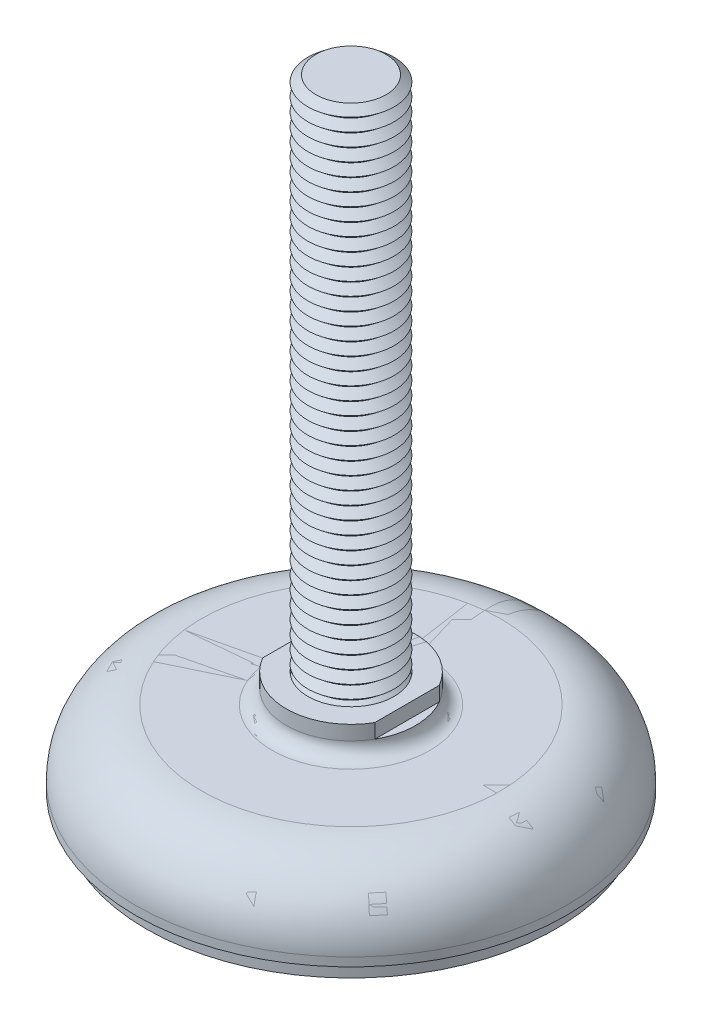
ISO-10303-21;
HEADER;
FILE_DESCRIPTION(('STEP AP214'),'2;1');
FILE_NAME('part.step','',(''),(''),'','','');
FILE_SCHEMA(('AUTOMOTIVE_DESIGN { 1 0 10303 214 1 1 1 1 }'));
ENDSEC;
DATA;
#1=APPLICATION_CONTEXT('core data for automotive mechanical design processes');
#2=APPLICATION_PROTOCOL_DEFINITION('international standard','automotive_design',2000,#1);
#3=PRODUCT_CONTEXT('',#1,'mechanical');
#4=PRODUCT('Part','Part','',(#3));
#5=PRODUCT_RELATED_PRODUCT_CATEGORY('part','',(#4));
#6=PRODUCT_DEFINITION_FORMATION('','',#4);
#7=PRODUCT_DEFINITION_CONTEXT('part definition',#1,'design');
#8=PRODUCT_DEFINITION('design','',#6,#7);
#9=PRODUCT_DEFINITION_SHAPE('','',#8);
#10=(LENGTH_UNIT() NAMED_UNIT(*) SI_UNIT(.MILLI.,.METRE.));
#11=(NAMED_UNIT(*) PLANE_ANGLE_UNIT() SI_UNIT($,.RADIAN.));
#12=(NAMED_UNIT(*) SI_UNIT($,.STERADIAN.) SOLID_ANGLE_UNIT());
#13=UNCERTAINTY_MEASURE_WITH_UNIT(LENGTH_MEASURE(1.E-05),#10,'distance_accuracy_value','');
#14=(GEOMETRIC_REPRESENTATION_CONTEXT(3) GLOBAL_UNCERTAINTY_ASSIGNED_CONTEXT((#13)) GLOBAL_UNIT_ASSIGNED_CONTEXT((#10,
#11,#12)) REPRESENTATION_CONTEXT('',''));
#15=CARTESIAN_POINT('',(0.,0.,0.));
#16=DIRECTION('',(0.,0.,1.));
#17=DIRECTION('',(1.,0.,0.));
#18=AXIS2_PLACEMENT_3D('',#15,#16,#17);
#19=CARTESIAN_POINT('',(0.,69.5,0.));
#20=DIRECTION('',(0.,-1.,0.));
#21=DIRECTION('',(0.998136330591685,0.,-0.0610234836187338));
#22=AXIS2_PLACEMENT_3D('',#19,#20,#21);
#23=CONICAL_SURFACE('',#22,4.06325030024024,0.895664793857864);
#24=CARTESIAN_POINT('',(0.,68.75,0.));
#25=DIRECTION('',(0.,-1.,0.));
#26=DIRECTION('',(0.998136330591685,0.,-0.0610234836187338));
#27=AXIS2_PLACEMENT_3D('',#24,#25,#26);
#28=CIRCLE('',#27,5.);
#29=CARTESIAN_POINT('',(4.99068165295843,68.75,-0.305117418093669));
#30=VERTEX_POINT('',#29);
#31=EDGE_CURVE('P0_E37',#30,#30,#28,.T.);
#32=ORIENTED_EDGE('',*,*,#31,.F.);
#33=EDGE_LOOP('',(#32));
#34=FACE_BOUND('',#33,.T.);
#35=CARTESIAN_POINT('',(0.,69.5,0.));
#36=DIRECTION('',(0.,-1.,0.));
#37=DIRECTION('',(0.998136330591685,0.,-0.0610234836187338));
#38=AXIS2_PLACEMENT_3D('',#35,#36,#37);
#39=CIRCLE('',#38,4.06325030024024);
#40=CARTESIAN_POINT('',(4.05567774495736,69.5,-0.247953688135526));
#41=VERTEX_POINT('',#40);
#42=EDGE_CURVE('P0_E25',#41,#41,#39,.T.);
#43=ORIENTED_EDGE('',*,*,#42,.T.);
#44=EDGE_LOOP('',(#43));
#45=FACE_BOUND('',#44,.T.);
#46=ADVANCED_FACE('P0_F14',(#34,#45),#23,.T.);
#47=CARTESIAN_POINT('',(0.,70.25,0.));
#48=DIRECTION('',(0.,1.,0.));
#49=DIRECTION('',(-0.998136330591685,0.,0.0610234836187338));
#50=AXIS2_PLACEMENT_3D('',#47,#48,#49);
#51=CONICAL_SURFACE('',#50,5.,0.895664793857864);
#52=ORIENTED_EDGE('',*,*,#42,.F.);
#53=EDGE_LOOP('',(#52));
#54=FACE_BOUND('',#53,.T.);
#55=CARTESIAN_POINT('',(0.,70.25,0.));
#56=DIRECTION('',(0.,-1.,0.));
#57=DIRECTION('',(0.998136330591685,0.,-0.0610234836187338));
#58=AXIS2_PLACEMENT_3D('',#55,#56,#57);
#59=CIRCLE('',#58,5.);
#60=CARTESIAN_POINT('',(4.99068165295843,70.25,-0.305117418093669));
#61=VERTEX_POINT('',#60);
#62=EDGE_CURVE('P0_E29',#61,#61,#59,.T.);
#63=ORIENTED_EDGE('',*,*,#62,.T.);
#64=EDGE_LOOP('',(#63));
#65=FACE_BOUND('',#64,.T.);
#66=ADVANCED_FACE('P0_F817',(#54,#65),#51,.T.);
#67=CARTESIAN_POINT('',(0.,71.,0.));
#68=DIRECTION('',(0.,1.,0.));
#69=DIRECTION('',(-0.998136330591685,0.,0.0610234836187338));
#70=AXIS2_PLACEMENT_3D('',#67,#68,#69);
#71=PLANE('',#70);
#72=CARTESIAN_POINT('',(0.,71.,0.));
#73=DIRECTION('',(0.,-1.,0.));
#74=DIRECTION('',(0.998136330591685,0.,-0.0610234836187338));
#75=AXIS2_PLACEMENT_3D('',#72,#73,#74);
#76=CIRCLE('',#75,4.06325030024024);
#77=CARTESIAN_POINT('',(4.05567774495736,71.,-0.247953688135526));
#78=VERTEX_POINT('',#77);
#79=EDGE_CURVE('P0_E21',#78,#78,#76,.T.);
#80=ORIENTED_EDGE('',*,*,#79,.F.);
#81=EDGE_LOOP('',(#80));
#82=FACE_BOUND('',#81,.T.);
#83=ADVANCED_FACE('P0_F823',(#82),#71,.T.);
#84=CARTESIAN_POINT('',(0.,71.,0.));
#85=DIRECTION('',(0.,-1.,0.));
#86=DIRECTION('',(0.998136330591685,0.,-0.0610234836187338));
#87=AXIS2_PLACEMENT_3D('',#84,#85,#86);
#88=CONICAL_SURFACE('',#87,4.06325030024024,0.895664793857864);
#89=ORIENTED_EDGE('',*,*,#62,.F.);
#90=EDGE_LOOP('',(#89));
#91=FACE_BOUND('',#90,.T.);
#92=ORIENTED_EDGE('',*,*,#79,.T.);
#93=EDGE_LOOP('',(#92));
#94=FACE_BOUND('',#93,.T.);
#95=ADVANCED_FACE('P0_F806',(#91,#94),#88,.T.);
#96=CARTESIAN_POINT('',(0.,68.,0.));
#97=DIRECTION('',(0.,-1.,0.));
#98=DIRECTION('',(0.998136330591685,0.,-0.0610234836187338));
#99=AXIS2_PLACEMENT_3D('',#96,#97,#98);
#100=CONICAL_SURFACE('',#99,4.06325030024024,0.895664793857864);
#101=CARTESIAN_POINT('',(0.,67.25,0.));
#102=DIRECTION('',(0.,-1.,0.));
#103=DIRECTION('',(0.998136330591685,0.,-0.0610234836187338));
#104=AXIS2_PLACEMENT_3D('',#101,#102,#103);
#105=CIRCLE('',#104,5.);
#106=CARTESIAN_POINT('',(4.99068165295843,67.25,-0.305117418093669));
#107=VERTEX_POINT('',#106);
#108=EDGE_CURVE('P0_E43',#107,#107,#105,.T.);
#109=ORIENTED_EDGE('',*,*,#108,.F.);
#110=EDGE_LOOP('',(#109));
#111=FACE_BOUND('',#110,.T.);
#112=CARTESIAN_POINT('',(0.,68.,0.));
#113=DIRECTION('',(0.,-1.,0.));
#114=DIRECTION('',(0.998136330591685,0.,-0.0610234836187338));
#115=AXIS2_PLACEMENT_3D('',#112,#113,#114);
#116=CIRCLE('',#115,4.06325030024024);
#117=CARTESIAN_POINT('',(4.05567774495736,68.,-0.247953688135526));
#118=VERTEX_POINT('',#117);
#119=EDGE_CURVE('P0_E34',#118,#118,#116,.T.);
#120=ORIENTED_EDGE('',*,*,#119,.T.);
#121=EDGE_LOOP('',(#120));
#122=FACE_BOUND('',#121,.T.);
#123=ADVANCED_FACE('P0_F803',(#111,#122),#100,.T.);
#124=CARTESIAN_POINT('',(0.,68.75,0.));
#125=DIRECTION('',(0.,1.,0.));
#126=DIRECTION('',(-0.998136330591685,0.,0.0610234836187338));
#127=AXIS2_PLACEMENT_3D('',#124,#125,#126);
#128=CONICAL_SURFACE('',#127,5.,0.895664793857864);
#129=ORIENTED_EDGE('',*,*,#119,.F.);
#130=EDGE_LOOP('',(#129));
#131=FACE_BOUND('',#130,.T.);
#132=ORIENTED_EDGE('',*,*,#31,.T.);
#133=EDGE_LOOP('',(#132));
#134=FACE_BOUND('',#133,.T.);
#135=ADVANCED_FACE('P0_F794',(#131,#134),#128,.T.);
#136=CARTESIAN_POINT('',(0.,66.5,0.));
#137=DIRECTION('',(0.,-1.,0.));
#138=DIRECTION('',(0.998136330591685,0.,-0.0610234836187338));
#139=AXIS2_PLACEMENT_3D('',#136,#137,#138);
#140=CONICAL_SURFACE('',#139,4.06325030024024,0.895664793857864);
#141=CARTESIAN_POINT('',(0.,65.75,0.));
#142=DIRECTION('',(0.,-1.,0.));
#143=DIRECTION('',(0.998136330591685,0.,-0.0610234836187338));
#144=AXIS2_PLACEMENT_3D('',#141,#142,#143);
#145=CIRCLE('',#144,5.);
#146=CARTESIAN_POINT('',(4.99068165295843,65.75,-0.305117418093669));
#147=VERTEX_POINT('',#146);
#148=EDGE_CURVE('P0_E49',#147,#147,#145,.T.);
#149=ORIENTED_EDGE('',*,*,#148,.F.);
#150=EDGE_LOOP('',(#149));
#151=FACE_BOUND('',#150,.T.);
#152=CARTESIAN_POINT('',(0.,66.5,0.));
#153=DIRECTION('',(0.,-1.,0.));
#154=DIRECTION('',(0.998136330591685,0.,-0.0610234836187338));
#155=AXIS2_PLACEMENT_3D('',#152,#153,#154);
#156=CIRCLE('',#155,4.06325030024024);
#157=CARTESIAN_POINT('',(4.05567774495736,66.5,-0.247953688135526));
#158=VERTEX_POINT('',#157);
#159=EDGE_CURVE('P0_E40',#158,#158,#156,.T.);
#160=ORIENTED_EDGE('',*,*,#159,.T.);
#161=EDGE_LOOP('',(#160));
#162=FACE_BOUND('',#161,.T.);
#163=ADVANCED_FACE('P0_F791',(#151,#162),#140,.T.);
#164=CARTESIAN_POINT('',(0.,67.25,0.));
#165=DIRECTION('',(0.,1.,0.));
#166=DIRECTION('',(-0.998136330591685,0.,0.0610234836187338));
#167=AXIS2_PLACEMENT_3D('',#164,#165,#166);
#168=CONICAL_SURFACE('',#167,5.,0.895664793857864);
#169=ORIENTED_EDGE('',*,*,#159,.F.);
#170=EDGE_LOOP('',(#169));
#171=FACE_BOUND('',#170,.T.);
#172=ORIENTED_EDGE('',*,*,#108,.T.);
#173=EDGE_LOOP('',(#172));
#174=FACE_BOUND('',#173,.T.);
#175=ADVANCED_FACE('P0_F782',(#171,#174),#168,.T.);
#176=CARTESIAN_POINT('',(0.,65.,0.));
#177=DIRECTION('',(0.,-1.,0.));
#178=DIRECTION('',(0.998136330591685,0.,-0.0610234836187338));
#179=AXIS2_PLACEMENT_3D('',#176,#177,#178);
#180=CONICAL_SURFACE('',#179,4.06325030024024,0.895664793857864);
#181=CARTESIAN_POINT('',(0.,64.25,0.));
#182=DIRECTION('',(0.,-1.,0.));
#183=DIRECTION('',(0.998136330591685,0.,-0.0610234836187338));
#184=AXIS2_PLACEMENT_3D('',#181,#182,#183);
#185=CIRCLE('',#184,5.);
#186=CARTESIAN_POINT('',(4.99068165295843,64.25,-0.305117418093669));
#187=VERTEX_POINT('',#186);
#188=EDGE_CURVE('P0_E55',#187,#187,#185,.T.);
#189=ORIENTED_EDGE('',*,*,#188,.F.);
#190=EDGE_LOOP('',(#189));
#191=FACE_BOUND('',#190,.T.);
#192=CARTESIAN_POINT('',(0.,65.,0.));
#193=DIRECTION('',(0.,-1.,0.));
#194=DIRECTION('',(0.998136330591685,0.,-0.0610234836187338));
#195=AXIS2_PLACEMENT_3D('',#192,#193,#194);
#196=CIRCLE('',#195,4.06325030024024);
#197=CARTESIAN_POINT('',(4.05567774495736,65.,-0.247953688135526));
#198=VERTEX_POINT('',#197);
#199=EDGE_CURVE('P0_E46',#198,#198,#196,.T.);
#200=ORIENTED_EDGE('',*,*,#199,.T.);
#201=EDGE_LOOP('',(#200));
#202=FACE_BOUND('',#201,.T.);
#203=ADVANCED_FACE('P0_F779',(#191,#202),#180,.T.);
#204=CARTESIAN_POINT('',(0.,65.75,0.));
#205=DIRECTION('',(0.,1.,0.));
#206=DIRECTION('',(-0.998136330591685,0.,0.0610234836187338));
#207=AXIS2_PLACEMENT_3D('',#204,#205,#206);
#208=CONICAL_SURFACE('',#207,5.,0.895664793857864);
#209=ORIENTED_EDGE('',*,*,#199,.F.);
#210=EDGE_LOOP('',(#209));
#211=FACE_BOUND('',#210,.T.);
#212=ORIENTED_EDGE('',*,*,#148,.T.);
#213=EDGE_LOOP('',(#212));
#214=FACE_BOUND('',#213,.T.);
#215=ADVANCED_FACE('P0_F770',(#211,#214),#208,.T.);
#216=CARTESIAN_POINT('',(0.,63.5,0.));
#217=DIRECTION('',(0.,-1.,0.));
#218=DIRECTION('',(0.998136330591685,0.,-0.0610234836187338));
#219=AXIS2_PLACEMENT_3D('',#216,#217,#218);
#220=CONICAL_SURFACE('',#219,4.06325030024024,0.895664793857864);
#221=CARTESIAN_POINT('',(0.,62.75,0.));
#222=DIRECTION('',(0.,-1.,0.));
#223=DIRECTION('',(0.998136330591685,0.,-0.0610234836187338));
#224=AXIS2_PLACEMENT_3D('',#221,#222,#223);
#225=CIRCLE('',#224,5.);
#226=CARTESIAN_POINT('',(4.99068165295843,62.75,-0.305117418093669));
#227=VERTEX_POINT('',#226);
#228=EDGE_CURVE('P0_E61',#227,#227,#225,.T.);
#229=ORIENTED_EDGE('',*,*,#228,.F.);
#230=EDGE_LOOP('',(#229));
#231=FACE_BOUND('',#230,.T.);
#232=CARTESIAN_POINT('',(0.,63.5,0.));
#233=DIRECTION('',(0.,-1.,0.));
#234=DIRECTION('',(0.998136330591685,0.,-0.0610234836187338));
#235=AXIS2_PLACEMENT_3D('',#232,#233,#234);
#236=CIRCLE('',#235,4.06325030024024);
#237=CARTESIAN_POINT('',(4.05567774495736,63.5,-0.247953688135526));
#238=VERTEX_POINT('',#237);
#239=EDGE_CURVE('P0_E52',#238,#238,#236,.T.);
#240=ORIENTED_EDGE('',*,*,#239,.T.);
#241=EDGE_LOOP('',(#240));
#242=FACE_BOUND('',#241,.T.);
#243=ADVANCED_FACE('P0_F767',(#231,#242),#220,.T.);
#244=CARTESIAN_POINT('',(0.,64.25,0.));
#245=DIRECTION('',(0.,1.,0.));
#246=DIRECTION('',(-0.998136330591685,0.,0.0610234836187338));
#247=AXIS2_PLACEMENT_3D('',#244,#245,#246);
#248=CONICAL_SURFACE('',#247,5.,0.895664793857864);
#249=ORIENTED_EDGE('',*,*,#239,.F.);
#250=EDGE_LOOP('',(#249));
#251=FACE_BOUND('',#250,.T.);
#252=ORIENTED_EDGE('',*,*,#188,.T.);
#253=EDGE_LOOP('',(#252));
#254=FACE_BOUND('',#253,.T.);
#255=ADVANCED_FACE('P0_F758',(#251,#254),#248,.T.);
#256=CARTESIAN_POINT('',(0.,62.,0.));
#257=DIRECTION('',(0.,-1.,0.));
#258=DIRECTION('',(0.998136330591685,0.,-0.0610234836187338));
#259=AXIS2_PLACEMENT_3D('',#256,#257,#258);
#260=CONICAL_SURFACE('',#259,4.06325030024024,0.895664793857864);
#261=CARTESIAN_POINT('',(0.,61.25,0.));
#262=DIRECTION('',(0.,-1.,0.));
#263=DIRECTION('',(0.998136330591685,0.,-0.0610234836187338));
#264=AXIS2_PLACEMENT_3D('',#261,#262,#263);
#265=CIRCLE('',#264,5.);
#266=CARTESIAN_POINT('',(4.99068165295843,61.25,-0.305117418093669));
#267=VERTEX_POINT('',#266);
#268=EDGE_CURVE('P0_E67',#267,#267,#265,.T.);
#269=ORIENTED_EDGE('',*,*,#268,.F.);
#270=EDGE_LOOP('',(#269));
#271=FACE_BOUND('',#270,.T.);
#272=CARTESIAN_POINT('',(0.,62.,0.));
#273=DIRECTION('',(0.,-1.,0.));
#274=DIRECTION('',(0.998136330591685,0.,-0.0610234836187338));
#275=AXIS2_PLACEMENT_3D('',#272,#273,#274);
#276=CIRCLE('',#275,4.06325030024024);
#277=CARTESIAN_POINT('',(4.05567774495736,62.,-0.247953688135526));
#278=VERTEX_POINT('',#277);
#279=EDGE_CURVE('P0_E58',#278,#278,#276,.T.);
#280=ORIENTED_EDGE('',*,*,#279,.T.);
#281=EDGE_LOOP('',(#280));
#282=FACE_BOUND('',#281,.T.);
#283=ADVANCED_FACE('P0_F755',(#271,#282),#260,.T.);
#284=CARTESIAN_POINT('',(0.,62.75,0.));
#285=DIRECTION('',(0.,1.,0.));
#286=DIRECTION('',(-0.998136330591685,0.,0.0610234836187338));
#287=AXIS2_PLACEMENT_3D('',#284,#285,#286);
#288=CONICAL_SURFACE('',#287,5.,0.895664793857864);
#289=ORIENTED_EDGE('',*,*,#279,.F.);
#290=EDGE_LOOP('',(#289));
#291=FACE_BOUND('',#290,.T.);
#292=ORIENTED_EDGE('',*,*,#228,.T.);
#293=EDGE_LOOP('',(#292));
#294=FACE_BOUND('',#293,.T.);
#295=ADVANCED_FACE('P0_F746',(#291,#294),#288,.T.);
#296=CARTESIAN_POINT('',(0.,60.5,0.));
#297=DIRECTION('',(0.,-1.,0.));
#298=DIRECTION('',(0.998136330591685,0.,-0.0610234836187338));
#299=AXIS2_PLACEMENT_3D('',#296,#297,#298);
#300=CONICAL_SURFACE('',#299,4.06325030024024,0.895664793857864);
#301=CARTESIAN_POINT('',(0.,59.75,0.));
#302=DIRECTION('',(0.,-1.,0.));
#303=DIRECTION('',(0.998136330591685,0.,-0.0610234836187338));
#304=AXIS2_PLACEMENT_3D('',#301,#302,#303);
#305=CIRCLE('',#304,5.);
#306=CARTESIAN_POINT('',(4.99068165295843,59.75,-0.305117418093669));
#307=VERTEX_POINT('',#306);
#308=EDGE_CURVE('P0_E73',#307,#307,#305,.T.);
#309=ORIENTED_EDGE('',*,*,#308,.F.);
#310=EDGE_LOOP('',(#309));
#311=FACE_BOUND('',#310,.T.);
#312=CARTESIAN_POINT('',(0.,60.5,0.));
#313=DIRECTION('',(0.,-1.,0.));
#314=DIRECTION('',(0.998136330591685,0.,-0.0610234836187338));
#315=AXIS2_PLACEMENT_3D('',#312,#313,#314);
#316=CIRCLE('',#315,4.06325030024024);
#317=CARTESIAN_POINT('',(4.05567774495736,60.5,-0.247953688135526));
#318=VERTEX_POINT('',#317);
#319=EDGE_CURVE('P0_E64',#318,#318,#316,.T.);
#320=ORIENTED_EDGE('',*,*,#319,.T.);
#321=EDGE_LOOP('',(#320));
#322=FACE_BOUND('',#321,.T.);
#323=ADVANCED_FACE('P0_F743',(#311,#322),#300,.T.);
#324=CARTESIAN_POINT('',(0.,61.25,0.));
#325=DIRECTION('',(0.,1.,0.));
#326=DIRECTION('',(-0.998136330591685,0.,0.0610234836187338));
#327=AXIS2_PLACEMENT_3D('',#324,#325,#326);
#328=CONICAL_SURFACE('',#327,5.,0.895664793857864);
#329=ORIENTED_EDGE('',*,*,#319,.F.);
#330=EDGE_LOOP('',(#329));
#331=FACE_BOUND('',#330,.T.);
#332=ORIENTED_EDGE('',*,*,#268,.T.);
#333=EDGE_LOOP('',(#332));
#334=FACE_BOUND('',#333,.T.);
#335=ADVANCED_FACE('P0_F734',(#331,#334),#328,.T.);
#336=CARTESIAN_POINT('',(0.,59.,0.));
#337=DIRECTION('',(0.,-1.,0.));
#338=DIRECTION('',(0.998136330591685,0.,-0.0610234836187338));
#339=AXIS2_PLACEMENT_3D('',#336,#337,#338);
#340=CONICAL_SURFACE('',#339,4.06325030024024,0.895664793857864);
#341=CARTESIAN_POINT('',(0.,58.25,0.));
#342=DIRECTION('',(0.,-1.,0.));
#343=DIRECTION('',(0.998136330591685,0.,-0.0610234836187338));
#344=AXIS2_PLACEMENT_3D('',#341,#342,#343);
#345=CIRCLE('',#344,5.);
#346=CARTESIAN_POINT('',(4.99068165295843,58.25,-0.305117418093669));
#347=VERTEX_POINT('',#346);
#348=EDGE_CURVE('P0_E79',#347,#347,#345,.T.);
#349=ORIENTED_EDGE('',*,*,#348,.F.);
#350=EDGE_LOOP('',(#349));
#351=FACE_BOUND('',#350,.T.);
#352=CARTESIAN_POINT('',(0.,59.,0.));
#353=DIRECTION('',(0.,-1.,0.));
#354=DIRECTION('',(0.998136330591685,0.,-0.0610234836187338));
#355=AXIS2_PLACEMENT_3D('',#352,#353,#354);
#356=CIRCLE('',#355,4.06325030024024);
#357=CARTESIAN_POINT('',(4.05567774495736,59.,-0.247953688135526));
#358=VERTEX_POINT('',#357);
#359=EDGE_CURVE('P0_E70',#358,#358,#356,.T.);
#360=ORIENTED_EDGE('',*,*,#359,.T.);
#361=EDGE_LOOP('',(#360));
#362=FACE_BOUND('',#361,.T.);
#363=ADVANCED_FACE('P0_F731',(#351,#362),#340,.T.);
#364=CARTESIAN_POINT('',(0.,59.75,0.));
#365=DIRECTION('',(0.,1.,0.));
#366=DIRECTION('',(-0.998136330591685,0.,0.0610234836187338));
#367=AXIS2_PLACEMENT_3D('',#364,#365,#366);
#368=CONICAL_SURFACE('',#367,5.,0.895664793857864);
#369=ORIENTED_EDGE('',*,*,#359,.F.);
#370=EDGE_LOOP('',(#369));
#371=FACE_BOUND('',#370,.T.);
#372=ORIENTED_EDGE('',*,*,#308,.T.);
#373=EDGE_LOOP('',(#372));
#374=FACE_BOUND('',#373,.T.);
#375=ADVANCED_FACE('P0_F722',(#371,#374),#368,.T.);
#376=CARTESIAN_POINT('',(0.,57.5,0.));
#377=DIRECTION('',(0.,-1.,0.));
#378=DIRECTION('',(0.998136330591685,0.,-0.0610234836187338));
#379=AXIS2_PLACEMENT_3D('',#376,#377,#378);
#380=CONICAL_SURFACE('',#379,4.06325030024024,0.895664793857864);
#381=CARTESIAN_POINT('',(0.,56.75,0.));
#382=DIRECTION('',(0.,-1.,0.));
#383=DIRECTION('',(0.998136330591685,0.,-0.0610234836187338));
#384=AXIS2_PLACEMENT_3D('',#381,#382,#383);
#385=CIRCLE('',#384,5.);
#386=CARTESIAN_POINT('',(4.99068165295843,56.75,-0.305117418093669));
#387=VERTEX_POINT('',#386);
#388=EDGE_CURVE('P0_E85',#387,#387,#385,.T.);
#389=ORIENTED_EDGE('',*,*,#388,.F.);
#390=EDGE_LOOP('',(#389));
#391=FACE_BOUND('',#390,.T.);
#392=CARTESIAN_POINT('',(0.,57.5,0.));
#393=DIRECTION('',(0.,-1.,0.));
#394=DIRECTION('',(0.998136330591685,0.,-0.0610234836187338));
#395=AXIS2_PLACEMENT_3D('',#392,#393,#394);
#396=CIRCLE('',#395,4.06325030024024);
#397=CARTESIAN_POINT('',(4.05567774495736,57.5,-0.247953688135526));
#398=VERTEX_POINT('',#397);
#399=EDGE_CURVE('P0_E76',#398,#398,#396,.T.);
#400=ORIENTED_EDGE('',*,*,#399,.T.);
#401=EDGE_LOOP('',(#400));
#402=FACE_BOUND('',#401,.T.);
#403=ADVANCED_FACE('P0_F719',(#391,#402),#380,.T.);
#404=CARTESIAN_POINT('',(0.,58.25,0.));
#405=DIRECTION('',(0.,1.,0.));
#406=DIRECTION('',(-0.998136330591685,0.,0.0610234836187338));
#407=AXIS2_PLACEMENT_3D('',#404,#405,#406);
#408=CONICAL_SURFACE('',#407,5.,0.895664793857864);
#409=ORIENTED_EDGE('',*,*,#399,.F.);
#410=EDGE_LOOP('',(#409));
#411=FACE_BOUND('',#410,.T.);
#412=ORIENTED_EDGE('',*,*,#348,.T.);
#413=EDGE_LOOP('',(#412));
#414=FACE_BOUND('',#413,.T.);
#415=ADVANCED_FACE('P0_F710',(#411,#414),#408,.T.);
#416=CARTESIAN_POINT('',(0.,56.,0.));
#417=DIRECTION('',(0.,-1.,0.));
#418=DIRECTION('',(0.998136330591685,0.,-0.0610234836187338));
#419=AXIS2_PLACEMENT_3D('',#416,#417,#418);
#420=CONICAL_SURFACE('',#419,4.06325030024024,0.895664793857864);
#421=CARTESIAN_POINT('',(0.,55.25,0.));
#422=DIRECTION('',(0.,-1.,0.));
#423=DIRECTION('',(0.998136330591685,0.,-0.0610234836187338));
#424=AXIS2_PLACEMENT_3D('',#421,#422,#423);
#425=CIRCLE('',#424,5.);
#426=CARTESIAN_POINT('',(4.99068165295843,55.25,-0.305117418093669));
#427=VERTEX_POINT('',#426);
#428=EDGE_CURVE('P0_E91',#427,#427,#425,.T.);
#429=ORIENTED_EDGE('',*,*,#428,.F.);
#430=EDGE_LOOP('',(#429));
#431=FACE_BOUND('',#430,.T.);
#432=CARTESIAN_POINT('',(0.,56.,0.));
#433=DIRECTION('',(0.,-1.,0.));
#434=DIRECTION('',(0.998136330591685,0.,-0.0610234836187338));
#435=AXIS2_PLACEMENT_3D('',#432,#433,#434);
#436=CIRCLE('',#435,4.06325030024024);
#437=CARTESIAN_POINT('',(4.05567774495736,56.,-0.247953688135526));
#438=VERTEX_POINT('',#437);
#439=EDGE_CURVE('P0_E82',#438,#438,#436,.T.);
#440=ORIENTED_EDGE('',*,*,#439,.T.);
#441=EDGE_LOOP('',(#440));
#442=FACE_BOUND('',#441,.T.);
#443=ADVANCED_FACE('P0_F707',(#431,#442),#420,.T.);
#444=CARTESIAN_POINT('',(0.,56.75,0.));
#445=DIRECTION('',(0.,1.,0.));
#446=DIRECTION('',(-0.998136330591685,0.,0.0610234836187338));
#447=AXIS2_PLACEMENT_3D('',#444,#445,#446);
#448=CONICAL_SURFACE('',#447,5.,0.895664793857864);
#449=ORIENTED_EDGE('',*,*,#439,.F.);
#450=EDGE_LOOP('',(#449));
#451=FACE_BOUND('',#450,.T.);
#452=ORIENTED_EDGE('',*,*,#388,.T.);
#453=EDGE_LOOP('',(#452));
#454=FACE_BOUND('',#453,.T.);
#455=ADVANCED_FACE('P0_F698',(#451,#454),#448,.T.);
#456=CARTESIAN_POINT('',(0.,54.5,0.));
#457=DIRECTION('',(0.,-1.,0.));
#458=DIRECTION('',(0.998136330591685,0.,-0.0610234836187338));
#459=AXIS2_PLACEMENT_3D('',#456,#457,#458);
#460=CONICAL_SURFACE('',#459,4.06325030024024,0.895664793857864);
#461=CARTESIAN_POINT('',(0.,53.75,0.));
#462=DIRECTION('',(0.,-1.,0.));
#463=DIRECTION('',(0.998136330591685,0.,-0.0610234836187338));
#464=AXIS2_PLACEMENT_3D('',#461,#462,#463);
#465=CIRCLE('',#464,5.);
#466=CARTESIAN_POINT('',(4.99068165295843,53.75,-0.305117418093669));
#467=VERTEX_POINT('',#466);
#468=EDGE_CURVE('P0_E97',#467,#467,#465,.T.);
#469=ORIENTED_EDGE('',*,*,#468,.F.);
#470=EDGE_LOOP('',(#469));
#471=FACE_BOUND('',#470,.T.);
#472=CARTESIAN_POINT('',(0.,54.5,0.));
#473=DIRECTION('',(0.,-1.,0.));
#474=DIRECTION('',(0.998136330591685,0.,-0.0610234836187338));
#475=AXIS2_PLACEMENT_3D('',#472,#473,#474);
#476=CIRCLE('',#475,4.06325030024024);
#477=CARTESIAN_POINT('',(4.05567774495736,54.5,-0.247953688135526));
#478=VERTEX_POINT('',#477);
#479=EDGE_CURVE('P0_E88',#478,#478,#476,.T.);
#480=ORIENTED_EDGE('',*,*,#479,.T.);
#481=EDGE_LOOP('',(#480));
#482=FACE_BOUND('',#481,.T.);
#483=ADVANCED_FACE('P0_F695',(#471,#482),#460,.T.);
#484=CARTESIAN_POINT('',(0.,55.25,0.));
#485=DIRECTION('',(0.,1.,0.));
#486=DIRECTION('',(-0.998136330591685,0.,0.0610234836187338));
#487=AXIS2_PLACEMENT_3D('',#484,#485,#486);
#488=CONICAL_SURFACE('',#487,5.,0.895664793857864);
#489=ORIENTED_EDGE('',*,*,#479,.F.);
#490=EDGE_LOOP('',(#489));
#491=FACE_BOUND('',#490,.T.);
#492=ORIENTED_EDGE('',*,*,#428,.T.);
#493=EDGE_LOOP('',(#492));
#494=FACE_BOUND('',#493,.T.);
#495=ADVANCED_FACE('P0_F686',(#491,#494),#488,.T.);
#496=CARTESIAN_POINT('',(0.,53.,0.));
#497=DIRECTION('',(0.,-1.,0.));
#498=DIRECTION('',(0.998136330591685,0.,-0.0610234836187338));
#499=AXIS2_PLACEMENT_3D('',#496,#497,#498);
#500=CONICAL_SURFACE('',#499,4.06325030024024,0.895664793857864);
#501=CARTESIAN_POINT('',(0.,52.25,0.));
#502=DIRECTION('',(0.,-1.,0.));
#503=DIRECTION('',(0.998136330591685,0.,-0.0610234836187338));
#504=AXIS2_PLACEMENT_3D('',#501,#502,#503);
#505=CIRCLE('',#504,5.);
#506=CARTESIAN_POINT('',(4.99068165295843,52.25,-0.305117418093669));
#507=VERTEX_POINT('',#506);
#508=EDGE_CURVE('P0_E103',#507,#507,#505,.T.);
#509=ORIENTED_EDGE('',*,*,#508,.F.);
#510=EDGE_LOOP('',(#509));
#511=FACE_BOUND('',#510,.T.);
#512=CARTESIAN_POINT('',(0.,53.,0.));
#513=DIRECTION('',(0.,-1.,0.));
#514=DIRECTION('',(0.998136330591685,0.,-0.0610234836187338));
#515=AXIS2_PLACEMENT_3D('',#512,#513,#514);
#516=CIRCLE('',#515,4.06325030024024);
#517=CARTESIAN_POINT('',(4.05567774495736,53.,-0.247953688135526));
#518=VERTEX_POINT('',#517);
#519=EDGE_CURVE('P0_E94',#518,#518,#516,.T.);
#520=ORIENTED_EDGE('',*,*,#519,.T.);
#521=EDGE_LOOP('',(#520));
#522=FACE_BOUND('',#521,.T.);
#523=ADVANCED_FACE('P0_F683',(#511,#522),#500,.T.);
#524=CARTESIAN_POINT('',(0.,53.75,0.));
#525=DIRECTION('',(0.,1.,0.));
#526=DIRECTION('',(-0.998136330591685,0.,0.0610234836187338));
#527=AXIS2_PLACEMENT_3D('',#524,#525,#526);
#528=CONICAL_SURFACE('',#527,5.,0.895664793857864);
#529=ORIENTED_EDGE('',*,*,#519,.F.);
#530=EDGE_LOOP('',(#529));
#531=FACE_BOUND('',#530,.T.);
#532=ORIENTED_EDGE('',*,*,#468,.T.);
#533=EDGE_LOOP('',(#532));
#534=FACE_BOUND('',#533,.T.);
#535=ADVANCED_FACE('P0_F674',(#531,#534),#528,.T.);
#536=CARTESIAN_POINT('',(0.,51.5,0.));
#537=DIRECTION('',(0.,-1.,0.));
#538=DIRECTION('',(0.998136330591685,0.,-0.0610234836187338));
#539=AXIS2_PLACEMENT_3D('',#536,#537,#538);
#540=CONICAL_SURFACE('',#539,4.06325030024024,0.895664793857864);
#541=CARTESIAN_POINT('',(0.,50.75,0.));
#542=DIRECTION('',(0.,-1.,0.));
#543=DIRECTION('',(0.998136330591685,0.,-0.0610234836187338));
#544=AXIS2_PLACEMENT_3D('',#541,#542,#543);
#545=CIRCLE('',#544,5.);
#546=CARTESIAN_POINT('',(4.99068165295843,50.75,-0.305117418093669));
#547=VERTEX_POINT('',#546);
#548=EDGE_CURVE('P0_E109',#547,#547,#545,.T.);
#549=ORIENTED_EDGE('',*,*,#548,.F.);
#550=EDGE_LOOP('',(#549));
#551=FACE_BOUND('',#550,.T.);
#552=CARTESIAN_POINT('',(0.,51.5,0.));
#553=DIRECTION('',(0.,-1.,0.));
#554=DIRECTION('',(0.998136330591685,0.,-0.0610234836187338));
#555=AXIS2_PLACEMENT_3D('',#552,#553,#554);
#556=CIRCLE('',#555,4.06325030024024);
#557=CARTESIAN_POINT('',(4.05567774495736,51.5,-0.247953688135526));
#558=VERTEX_POINT('',#557);
#559=EDGE_CURVE('P0_E100',#558,#558,#556,.T.);
#560=ORIENTED_EDGE('',*,*,#559,.T.);
#561=EDGE_LOOP('',(#560));
#562=FACE_BOUND('',#561,.T.);
#563=ADVANCED_FACE('P0_F671',(#551,#562),#540,.T.);
#564=CARTESIAN_POINT('',(0.,52.25,0.));
#565=DIRECTION('',(0.,1.,0.));
#566=DIRECTION('',(-0.998136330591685,0.,0.0610234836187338));
#567=AXIS2_PLACEMENT_3D('',#564,#565,#566);
#568=CONICAL_SURFACE('',#567,5.,0.895664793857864);
#569=ORIENTED_EDGE('',*,*,#559,.F.);
#570=EDGE_LOOP('',(#569));
#571=FACE_BOUND('',#570,.T.);
#572=ORIENTED_EDGE('',*,*,#508,.T.);
#573=EDGE_LOOP('',(#572));
#574=FACE_BOUND('',#573,.T.);
#575=ADVANCED_FACE('P0_F662',(#571,#574),#568,.T.);
#576=CARTESIAN_POINT('',(0.,50.,0.));
#577=DIRECTION('',(0.,-1.,0.));
#578=DIRECTION('',(0.998136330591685,0.,-0.0610234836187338));
#579=AXIS2_PLACEMENT_3D('',#576,#577,#578);
#580=CONICAL_SURFACE('',#579,4.06325030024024,0.895664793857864);
#581=CARTESIAN_POINT('',(0.,49.25,0.));
#582=DIRECTION('',(0.,-1.,0.));
#583=DIRECTION('',(0.998136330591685,0.,-0.0610234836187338));
#584=AXIS2_PLACEMENT_3D('',#581,#582,#583);
#585=CIRCLE('',#584,5.);
#586=CARTESIAN_POINT('',(4.99068165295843,49.25,-0.305117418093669));
#587=VERTEX_POINT('',#586);
#588=EDGE_CURVE('P0_E115',#587,#587,#585,.T.);
#589=ORIENTED_EDGE('',*,*,#588,.F.);
#590=EDGE_LOOP('',(#589));
#591=FACE_BOUND('',#590,.T.);
#592=CARTESIAN_POINT('',(0.,50.,0.));
#593=DIRECTION('',(0.,-1.,0.));
#594=DIRECTION('',(0.998136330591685,0.,-0.0610234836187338));
#595=AXIS2_PLACEMENT_3D('',#592,#593,#594);
#596=CIRCLE('',#595,4.06325030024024);
#597=CARTESIAN_POINT('',(4.05567774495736,50.,-0.247953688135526));
#598=VERTEX_POINT('',#597);
#599=EDGE_CURVE('P0_E106',#598,#598,#596,.T.);
#600=ORIENTED_EDGE('',*,*,#599,.T.);
#601=EDGE_LOOP('',(#600));
#602=FACE_BOUND('',#601,.T.);
#603=ADVANCED_FACE('P0_F659',(#591,#602),#580,.T.);
#604=CARTESIAN_POINT('',(0.,50.75,0.));
#605=DIRECTION('',(0.,1.,0.));
#606=DIRECTION('',(-0.998136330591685,0.,0.0610234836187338));
#607=AXIS2_PLACEMENT_3D('',#604,#605,#606);
#608=CONICAL_SURFACE('',#607,5.,0.895664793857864);
#609=ORIENTED_EDGE('',*,*,#599,.F.);
#610=EDGE_LOOP('',(#609));
#611=FACE_BOUND('',#610,.T.);
#612=ORIENTED_EDGE('',*,*,#548,.T.);
#613=EDGE_LOOP('',(#612));
#614=FACE_BOUND('',#613,.T.);
#615=ADVANCED_FACE('P0_F650',(#611,#614),#608,.T.);
#616=CARTESIAN_POINT('',(0.,48.5,0.));
#617=DIRECTION('',(0.,-1.,0.));
#618=DIRECTION('',(0.998136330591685,0.,-0.0610234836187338));
#619=AXIS2_PLACEMENT_3D('',#616,#617,#618);
#620=CONICAL_SURFACE('',#619,4.06325030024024,0.895664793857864);
#621=CARTESIAN_POINT('',(0.,47.75,0.));
#622=DIRECTION('',(0.,-1.,0.));
#623=DIRECTION('',(0.998136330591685,0.,-0.0610234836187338));
#624=AXIS2_PLACEMENT_3D('',#621,#622,#623);
#625=CIRCLE('',#624,5.);
#626=CARTESIAN_POINT('',(4.99068165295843,47.75,-0.305117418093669));
#627=VERTEX_POINT('',#626);
#628=EDGE_CURVE('P0_E121',#627,#627,#625,.T.);
#629=ORIENTED_EDGE('',*,*,#628,.F.);
#630=EDGE_LOOP('',(#629));
#631=FACE_BOUND('',#630,.T.);
#632=CARTESIAN_POINT('',(0.,48.5,0.));
#633=DIRECTION('',(0.,-1.,0.));
#634=DIRECTION('',(0.998136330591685,0.,-0.0610234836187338));
#635=AXIS2_PLACEMENT_3D('',#632,#633,#634);
#636=CIRCLE('',#635,4.06325030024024);
#637=CARTESIAN_POINT('',(4.05567774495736,48.5,-0.247953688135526));
#638=VERTEX_POINT('',#637);
#639=EDGE_CURVE('P0_E112',#638,#638,#636,.T.);
#640=ORIENTED_EDGE('',*,*,#639,.T.);
#641=EDGE_LOOP('',(#640));
#642=FACE_BOUND('',#641,.T.);
#643=ADVANCED_FACE('P0_F647',(#631,#642),#620,.T.);
#644=CARTESIAN_POINT('',(0.,49.25,0.));
#645=DIRECTION('',(0.,1.,0.));
#646=DIRECTION('',(-0.998136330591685,0.,0.0610234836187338));
#647=AXIS2_PLACEMENT_3D('',#644,#645,#646);
#648=CONICAL_SURFACE('',#647,5.,0.895664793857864);
#649=ORIENTED_EDGE('',*,*,#639,.F.);
#650=EDGE_LOOP('',(#649));
#651=FACE_BOUND('',#650,.T.);
#652=ORIENTED_EDGE('',*,*,#588,.T.);
#653=EDGE_LOOP('',(#652));
#654=FACE_BOUND('',#653,.T.);
#655=ADVANCED_FACE('P0_F638',(#651,#654),#648,.T.);
#656=CARTESIAN_POINT('',(0.,47.,0.));
#657=DIRECTION('',(0.,-1.,0.));
#658=DIRECTION('',(0.998136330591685,0.,-0.0610234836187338));
#659=AXIS2_PLACEMENT_3D('',#656,#657,#658);
#660=CONICAL_SURFACE('',#659,4.06325030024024,0.895664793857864);
#661=CARTESIAN_POINT('',(0.,46.25,0.));
#662=DIRECTION('',(0.,-1.,0.));
#663=DIRECTION('',(0.998136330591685,0.,-0.0610234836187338));
#664=AXIS2_PLACEMENT_3D('',#661,#662,#663);
#665=CIRCLE('',#664,5.);
#666=CARTESIAN_POINT('',(4.99068165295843,46.25,-0.305117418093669));
#667=VERTEX_POINT('',#666);
#668=EDGE_CURVE('P0_E127',#667,#667,#665,.T.);
#669=ORIENTED_EDGE('',*,*,#668,.F.);
#670=EDGE_LOOP('',(#669));
#671=FACE_BOUND('',#670,.T.);
#672=CARTESIAN_POINT('',(0.,47.,0.));
#673=DIRECTION('',(0.,-1.,0.));
#674=DIRECTION('',(0.998136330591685,0.,-0.0610234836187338));
#675=AXIS2_PLACEMENT_3D('',#672,#673,#674);
#676=CIRCLE('',#675,4.06325030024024);
#677=CARTESIAN_POINT('',(4.05567774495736,47.,-0.247953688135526));
#678=VERTEX_POINT('',#677);
#679=EDGE_CURVE('P0_E118',#678,#678,#676,.T.);
#680=ORIENTED_EDGE('',*,*,#679,.T.);
#681=EDGE_LOOP('',(#680));
#682=FACE_BOUND('',#681,.T.);
#683=ADVANCED_FACE('P0_F635',(#671,#682),#660,.T.);
#684=CARTESIAN_POINT('',(0.,47.75,0.));
#685=DIRECTION('',(0.,1.,0.));
#686=DIRECTION('',(-0.998136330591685,0.,0.0610234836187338));
#687=AXIS2_PLACEMENT_3D('',#684,#685,#686);
#688=CONICAL_SURFACE('',#687,5.,0.895664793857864);
#689=ORIENTED_EDGE('',*,*,#679,.F.);
#690=EDGE_LOOP('',(#689));
#691=FACE_BOUND('',#690,.T.);
#692=ORIENTED_EDGE('',*,*,#628,.T.);
#693=EDGE_LOOP('',(#692));
#694=FACE_BOUND('',#693,.T.);
#695=ADVANCED_FACE('P0_F626',(#691,#694),#688,.T.);
#696=CARTESIAN_POINT('',(0.,45.5,0.));
#697=DIRECTION('',(0.,-1.,0.));
#698=DIRECTION('',(0.998136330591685,0.,-0.0610234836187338));
#699=AXIS2_PLACEMENT_3D('',#696,#697,#698);
#700=CONICAL_SURFACE('',#699,4.06325030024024,0.895664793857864);
#701=CARTESIAN_POINT('',(0.,44.75,0.));
#702=DIRECTION('',(0.,-1.,0.));
#703=DIRECTION('',(0.998136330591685,0.,-0.0610234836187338));
#704=AXIS2_PLACEMENT_3D('',#701,#702,#703);
#705=CIRCLE('',#704,5.);
#706=CARTESIAN_POINT('',(4.99068165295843,44.75,-0.305117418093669));
#707=VERTEX_POINT('',#706);
#708=EDGE_CURVE('P0_E133',#707,#707,#705,.T.);
#709=ORIENTED_EDGE('',*,*,#708,.F.);
#710=EDGE_LOOP('',(#709));
#711=FACE_BOUND('',#710,.T.);
#712=CARTESIAN_POINT('',(0.,45.5,0.));
#713=DIRECTION('',(0.,-1.,0.));
#714=DIRECTION('',(0.998136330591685,0.,-0.0610234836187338));
#715=AXIS2_PLACEMENT_3D('',#712,#713,#714);
#716=CIRCLE('',#715,4.06325030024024);
#717=CARTESIAN_POINT('',(4.05567774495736,45.5,-0.247953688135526));
#718=VERTEX_POINT('',#717);
#719=EDGE_CURVE('P0_E124',#718,#718,#716,.T.);
#720=ORIENTED_EDGE('',*,*,#719,.T.);
#721=EDGE_LOOP('',(#720));
#722=FACE_BOUND('',#721,.T.);
#723=ADVANCED_FACE('P0_F623',(#711,#722),#700,.T.);
#724=CARTESIAN_POINT('',(0.,46.25,0.));
#725=DIRECTION('',(0.,1.,0.));
#726=DIRECTION('',(-0.998136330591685,0.,0.0610234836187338));
#727=AXIS2_PLACEMENT_3D('',#724,#725,#726);
#728=CONICAL_SURFACE('',#727,5.,0.895664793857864);
#729=ORIENTED_EDGE('',*,*,#719,.F.);
#730=EDGE_LOOP('',(#729));
#731=FACE_BOUND('',#730,.T.);
#732=ORIENTED_EDGE('',*,*,#668,.T.);
#733=EDGE_LOOP('',(#732));
#734=FACE_BOUND('',#733,.T.);
#735=ADVANCED_FACE('P0_F614',(#731,#734),#728,.T.);
#736=CARTESIAN_POINT('',(0.,44.,0.));
#737=DIRECTION('',(0.,-1.,0.));
#738=DIRECTION('',(0.998136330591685,0.,-0.0610234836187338));
#739=AXIS2_PLACEMENT_3D('',#736,#737,#738);
#740=CONICAL_SURFACE('',#739,4.06325030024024,0.895664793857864);
#741=CARTESIAN_POINT('',(0.,43.25,0.));
#742=DIRECTION('',(0.,-1.,0.));
#743=DIRECTION('',(0.998136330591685,0.,-0.0610234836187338));
#744=AXIS2_PLACEMENT_3D('',#741,#742,#743);
#745=CIRCLE('',#744,5.);
#746=CARTESIAN_POINT('',(4.99068165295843,43.25,-0.305117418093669));
#747=VERTEX_POINT('',#746);
#748=EDGE_CURVE('P0_E139',#747,#747,#745,.T.);
#749=ORIENTED_EDGE('',*,*,#748,.F.);
#750=EDGE_LOOP('',(#749));
#751=FACE_BOUND('',#750,.T.);
#752=CARTESIAN_POINT('',(0.,44.,0.));
#753=DIRECTION('',(0.,-1.,0.));
#754=DIRECTION('',(0.998136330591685,0.,-0.0610234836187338));
#755=AXIS2_PLACEMENT_3D('',#752,#753,#754);
#756=CIRCLE('',#755,4.06325030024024);
#757=CARTESIAN_POINT('',(4.05567774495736,44.,-0.247953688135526));
#758=VERTEX_POINT('',#757);
#759=EDGE_CURVE('P0_E130',#758,#758,#756,.T.);
#760=ORIENTED_EDGE('',*,*,#759,.T.);
#761=EDGE_LOOP('',(#760));
#762=FACE_BOUND('',#761,.T.);
#763=ADVANCED_FACE('P0_F611',(#751,#762),#740,.T.);
#764=CARTESIAN_POINT('',(0.,44.75,0.));
#765=DIRECTION('',(0.,1.,0.));
#766=DIRECTION('',(-0.998136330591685,0.,0.0610234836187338));
#767=AXIS2_PLACEMENT_3D('',#764,#765,#766);
#768=CONICAL_SURFACE('',#767,5.,0.895664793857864);
#769=ORIENTED_EDGE('',*,*,#759,.F.);
#770=EDGE_LOOP('',(#769));
#771=FACE_BOUND('',#770,.T.);
#772=ORIENTED_EDGE('',*,*,#708,.T.);
#773=EDGE_LOOP('',(#772));
#774=FACE_BOUND('',#773,.T.);
#775=ADVANCED_FACE('P0_F602',(#771,#774),#768,.T.);
#776=CARTESIAN_POINT('',(0.,42.5,0.));
#777=DIRECTION('',(0.,-1.,0.));
#778=DIRECTION('',(0.998136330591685,0.,-0.0610234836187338));
#779=AXIS2_PLACEMENT_3D('',#776,#777,#778);
#780=CONICAL_SURFACE('',#779,4.06325030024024,0.895664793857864);
#781=CARTESIAN_POINT('',(0.,41.75,0.));
#782=DIRECTION('',(0.,-1.,0.));
#783=DIRECTION('',(0.998136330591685,0.,-0.0610234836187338));
#784=AXIS2_PLACEMENT_3D('',#781,#782,#783);
#785=CIRCLE('',#784,5.);
#786=CARTESIAN_POINT('',(4.99068165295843,41.75,-0.305117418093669));
#787=VERTEX_POINT('',#786);
#788=EDGE_CURVE('P0_E145',#787,#787,#785,.T.);
#789=ORIENTED_EDGE('',*,*,#788,.F.);
#790=EDGE_LOOP('',(#789));
#791=FACE_BOUND('',#790,.T.);
#792=CARTESIAN_POINT('',(0.,42.5,0.));
#793=DIRECTION('',(0.,-1.,0.));
#794=DIRECTION('',(0.998136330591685,0.,-0.0610234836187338));
#795=AXIS2_PLACEMENT_3D('',#792,#793,#794);
#796=CIRCLE('',#795,4.06325030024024);
#797=CARTESIAN_POINT('',(4.05567774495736,42.5,-0.247953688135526));
#798=VERTEX_POINT('',#797);
#799=EDGE_CURVE('P0_E136',#798,#798,#796,.T.);
#800=ORIENTED_EDGE('',*,*,#799,.T.);
#801=EDGE_LOOP('',(#800));
#802=FACE_BOUND('',#801,.T.);
#803=ADVANCED_FACE('P0_F599',(#791,#802),#780,.T.);
#804=CARTESIAN_POINT('',(0.,43.25,0.));
#805=DIRECTION('',(0.,1.,0.));
#806=DIRECTION('',(-0.998136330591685,0.,0.0610234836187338));
#807=AXIS2_PLACEMENT_3D('',#804,#805,#806);
#808=CONICAL_SURFACE('',#807,5.,0.895664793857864);
#809=ORIENTED_EDGE('',*,*,#799,.F.);
#810=EDGE_LOOP('',(#809));
#811=FACE_BOUND('',#810,.T.);
#812=ORIENTED_EDGE('',*,*,#748,.T.);
#813=EDGE_LOOP('',(#812));
#814=FACE_BOUND('',#813,.T.);
#815=ADVANCED_FACE('P0_F590',(#811,#814),#808,.T.);
#816=CARTESIAN_POINT('',(0.,41.,0.));
#817=DIRECTION('',(0.,-1.,0.));
#818=DIRECTION('',(0.998136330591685,0.,-0.0610234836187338));
#819=AXIS2_PLACEMENT_3D('',#816,#817,#818);
#820=CONICAL_SURFACE('',#819,4.06325030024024,0.895664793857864);
#821=CARTESIAN_POINT('',(0.,40.25,0.));
#822=DIRECTION('',(0.,-1.,0.));
#823=DIRECTION('',(0.998136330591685,0.,-0.0610234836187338));
#824=AXIS2_PLACEMENT_3D('',#821,#822,#823);
#825=CIRCLE('',#824,5.);
#826=CARTESIAN_POINT('',(4.99068165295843,40.25,-0.305117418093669));
#827=VERTEX_POINT('',#826);
#828=EDGE_CURVE('P0_E151',#827,#827,#825,.T.);
#829=ORIENTED_EDGE('',*,*,#828,.F.);
#830=EDGE_LOOP('',(#829));
#831=FACE_BOUND('',#830,.T.);
#832=CARTESIAN_POINT('',(0.,41.,0.));
#833=DIRECTION('',(0.,-1.,0.));
#834=DIRECTION('',(0.998136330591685,0.,-0.0610234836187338));
#835=AXIS2_PLACEMENT_3D('',#832,#833,#834);
#836=CIRCLE('',#835,4.06325030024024);
#837=CARTESIAN_POINT('',(4.05567774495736,41.,-0.247953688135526));
#838=VERTEX_POINT('',#837);
#839=EDGE_CURVE('P0_E142',#838,#838,#836,.T.);
#840=ORIENTED_EDGE('',*,*,#839,.T.);
#841=EDGE_LOOP('',(#840));
#842=FACE_BOUND('',#841,.T.);
#843=ADVANCED_FACE('P0_F587',(#831,#842),#820,.T.);
#844=CARTESIAN_POINT('',(0.,41.75,0.));
#845=DIRECTION('',(0.,1.,0.));
#846=DIRECTION('',(-0.998136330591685,0.,0.0610234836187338));
#847=AXIS2_PLACEMENT_3D('',#844,#845,#846);
#848=CONICAL_SURFACE('',#847,5.,0.895664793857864);
#849=ORIENTED_EDGE('',*,*,#839,.F.);
#850=EDGE_LOOP('',(#849));
#851=FACE_BOUND('',#850,.T.);
#852=ORIENTED_EDGE('',*,*,#788,.T.);
#853=EDGE_LOOP('',(#852));
#854=FACE_BOUND('',#853,.T.);
#855=ADVANCED_FACE('P0_F578',(#851,#854),#848,.T.);
#856=CARTESIAN_POINT('',(0.,39.5,0.));
#857=DIRECTION('',(0.,-1.,0.));
#858=DIRECTION('',(0.998136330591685,0.,-0.0610234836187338));
#859=AXIS2_PLACEMENT_3D('',#856,#857,#858);
#860=CONICAL_SURFACE('',#859,4.06325030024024,0.895664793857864);
#861=CARTESIAN_POINT('',(0.,38.75,0.));
#862=DIRECTION('',(0.,-1.,0.));
#863=DIRECTION('',(0.998136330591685,0.,-0.0610234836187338));
#864=AXIS2_PLACEMENT_3D('',#861,#862,#863);
#865=CIRCLE('',#864,5.);
#866=CARTESIAN_POINT('',(4.99068165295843,38.75,-0.305117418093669));
#867=VERTEX_POINT('',#866);
#868=EDGE_CURVE('P0_E157',#867,#867,#865,.T.);
#869=ORIENTED_EDGE('',*,*,#868,.F.);
#870=EDGE_LOOP('',(#869));
#871=FACE_BOUND('',#870,.T.);
#872=CARTESIAN_POINT('',(0.,39.5,0.));
#873=DIRECTION('',(0.,-1.,0.));
#874=DIRECTION('',(0.998136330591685,0.,-0.0610234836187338));
#875=AXIS2_PLACEMENT_3D('',#872,#873,#874);
#876=CIRCLE('',#875,4.06325030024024);
#877=CARTESIAN_POINT('',(4.05567774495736,39.5,-0.247953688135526));
#878=VERTEX_POINT('',#877);
#879=EDGE_CURVE('P0_E148',#878,#878,#876,.T.);
#880=ORIENTED_EDGE('',*,*,#879,.T.);
#881=EDGE_LOOP('',(#880));
#882=FACE_BOUND('',#881,.T.);
#883=ADVANCED_FACE('P0_F575',(#871,#882),#860,.T.);
#884=CARTESIAN_POINT('',(0.,40.25,0.));
#885=DIRECTION('',(0.,1.,0.));
#886=DIRECTION('',(-0.998136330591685,0.,0.0610234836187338));
#887=AXIS2_PLACEMENT_3D('',#884,#885,#886);
#888=CONICAL_SURFACE('',#887,5.,0.895664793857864);
#889=ORIENTED_EDGE('',*,*,#879,.F.);
#890=EDGE_LOOP('',(#889));
#891=FACE_BOUND('',#890,.T.);
#892=ORIENTED_EDGE('',*,*,#828,.T.);
#893=EDGE_LOOP('',(#892));
#894=FACE_BOUND('',#893,.T.);
#895=ADVANCED_FACE('P0_F566',(#891,#894),#888,.T.);
#896=CARTESIAN_POINT('',(0.,38.,0.));
#897=DIRECTION('',(0.,-1.,0.));
#898=DIRECTION('',(0.998136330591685,0.,-0.0610234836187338));
#899=AXIS2_PLACEMENT_3D('',#896,#897,#898);
#900=CONICAL_SURFACE('',#899,4.06325030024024,0.895664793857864);
#901=CARTESIAN_POINT('',(0.,37.25,0.));
#902=DIRECTION('',(0.,-1.,0.));
#903=DIRECTION('',(0.998136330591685,0.,-0.0610234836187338));
#904=AXIS2_PLACEMENT_3D('',#901,#902,#903);
#905=CIRCLE('',#904,5.);
#906=CARTESIAN_POINT('',(4.99068165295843,37.25,-0.305117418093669));
#907=VERTEX_POINT('',#906);
#908=EDGE_CURVE('P0_E163',#907,#907,#905,.T.);
#909=ORIENTED_EDGE('',*,*,#908,.F.);
#910=EDGE_LOOP('',(#909));
#911=FACE_BOUND('',#910,.T.);
#912=CARTESIAN_POINT('',(0.,38.,0.));
#913=DIRECTION('',(0.,-1.,0.));
#914=DIRECTION('',(0.998136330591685,0.,-0.0610234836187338));
#915=AXIS2_PLACEMENT_3D('',#912,#913,#914);
#916=CIRCLE('',#915,4.06325030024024);
#917=CARTESIAN_POINT('',(4.05567774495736,38.,-0.247953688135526));
#918=VERTEX_POINT('',#917);
#919=EDGE_CURVE('P0_E154',#918,#918,#916,.T.);
#920=ORIENTED_EDGE('',*,*,#919,.T.);
#921=EDGE_LOOP('',(#920));
#922=FACE_BOUND('',#921,.T.);
#923=ADVANCED_FACE('P0_F563',(#911,#922),#900,.T.);
#924=CARTESIAN_POINT('',(0.,38.75,0.));
#925=DIRECTION('',(0.,1.,0.));
#926=DIRECTION('',(-0.998136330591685,0.,0.0610234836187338));
#927=AXIS2_PLACEMENT_3D('',#924,#925,#926);
#928=CONICAL_SURFACE('',#927,5.,0.895664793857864);
#929=ORIENTED_EDGE('',*,*,#919,.F.);
#930=EDGE_LOOP('',(#929));
#931=FACE_BOUND('',#930,.T.);
#932=ORIENTED_EDGE('',*,*,#868,.T.);
#933=EDGE_LOOP('',(#932));
#934=FACE_BOUND('',#933,.T.);
#935=ADVANCED_FACE('P0_F554',(#931,#934),#928,.T.);
#936=CARTESIAN_POINT('',(0.,36.5,0.));
#937=DIRECTION('',(0.,-1.,0.));
#938=DIRECTION('',(0.998136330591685,0.,-0.0610234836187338));
#939=AXIS2_PLACEMENT_3D('',#936,#937,#938);
#940=CONICAL_SURFACE('',#939,4.06325030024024,0.895664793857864);
#941=CARTESIAN_POINT('',(0.,35.75,0.));
#942=DIRECTION('',(0.,-1.,0.));
#943=DIRECTION('',(0.998136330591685,0.,-0.0610234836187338));
#944=AXIS2_PLACEMENT_3D('',#941,#942,#943);
#945=CIRCLE('',#944,5.);
#946=CARTESIAN_POINT('',(4.99068165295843,35.75,-0.305117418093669));
#947=VERTEX_POINT('',#946);
#948=EDGE_CURVE('P0_E169',#947,#947,#945,.T.);
#949=ORIENTED_EDGE('',*,*,#948,.F.);
#950=EDGE_LOOP('',(#949));
#951=FACE_BOUND('',#950,.T.);
#952=CARTESIAN_POINT('',(0.,36.5,0.));
#953=DIRECTION('',(0.,-1.,0.));
#954=DIRECTION('',(0.998136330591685,0.,-0.0610234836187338));
#955=AXIS2_PLACEMENT_3D('',#952,#953,#954);
#956=CIRCLE('',#955,4.06325030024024);
#957=CARTESIAN_POINT('',(4.05567774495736,36.5,-0.247953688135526));
#958=VERTEX_POINT('',#957);
#959=EDGE_CURVE('P0_E160',#958,#958,#956,.T.);
#960=ORIENTED_EDGE('',*,*,#959,.T.);
#961=EDGE_LOOP('',(#960));
#962=FACE_BOUND('',#961,.T.);
#963=ADVANCED_FACE('P0_F551',(#951,#962),#940,.T.);
#964=CARTESIAN_POINT('',(0.,37.25,0.));
#965=DIRECTION('',(0.,1.,0.));
#966=DIRECTION('',(-0.998136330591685,0.,0.0610234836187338));
#967=AXIS2_PLACEMENT_3D('',#964,#965,#966);
#968=CONICAL_SURFACE('',#967,5.,0.895664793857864);
#969=ORIENTED_EDGE('',*,*,#959,.F.);
#970=EDGE_LOOP('',(#969));
#971=FACE_BOUND('',#970,.T.);
#972=ORIENTED_EDGE('',*,*,#908,.T.);
#973=EDGE_LOOP('',(#972));
#974=FACE_BOUND('',#973,.T.);
#975=ADVANCED_FACE('P0_F542',(#971,#974),#968,.T.);
#976=CARTESIAN_POINT('',(0.,35.,0.));
#977=DIRECTION('',(0.,-1.,0.));
#978=DIRECTION('',(0.998136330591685,0.,-0.0610234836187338));
#979=AXIS2_PLACEMENT_3D('',#976,#977,#978);
#980=CONICAL_SURFACE('',#979,4.06325030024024,0.895664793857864);
#981=CARTESIAN_POINT('',(0.,34.25,0.));
#982=DIRECTION('',(0.,-1.,0.));
#983=DIRECTION('',(0.998136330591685,0.,-0.0610234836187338));
#984=AXIS2_PLACEMENT_3D('',#981,#982,#983);
#985=CIRCLE('',#984,5.);
#986=CARTESIAN_POINT('',(4.99068165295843,34.25,-0.305117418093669));
#987=VERTEX_POINT('',#986);
#988=EDGE_CURVE('P0_E175',#987,#987,#985,.T.);
#989=ORIENTED_EDGE('',*,*,#988,.F.);
#990=EDGE_LOOP('',(#989));
#991=FACE_BOUND('',#990,.T.);
#992=CARTESIAN_POINT('',(0.,35.,0.));
#993=DIRECTION('',(0.,-1.,0.));
#994=DIRECTION('',(0.998136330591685,0.,-0.0610234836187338));
#995=AXIS2_PLACEMENT_3D('',#992,#993,#994);
#996=CIRCLE('',#995,4.06325030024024);
#997=CARTESIAN_POINT('',(4.05567774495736,35.,-0.247953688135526));
#998=VERTEX_POINT('',#997);
#999=EDGE_CURVE('P0_E166',#998,#998,#996,.T.);
#1000=ORIENTED_EDGE('',*,*,#999,.T.);
#1001=EDGE_LOOP('',(#1000));
#1002=FACE_BOUND('',#1001,.T.);
#1003=ADVANCED_FACE('P0_F539',(#991,#1002),#980,.T.);
#1004=CARTESIAN_POINT('',(0.,35.75,0.));
#1005=DIRECTION('',(0.,1.,0.));
#1006=DIRECTION('',(-0.998136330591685,0.,0.0610234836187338));
#1007=AXIS2_PLACEMENT_3D('',#1004,#1005,#1006);
#1008=CONICAL_SURFACE('',#1007,5.,0.895664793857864);
#1009=ORIENTED_EDGE('',*,*,#999,.F.);
#1010=EDGE_LOOP('',(#1009));
#1011=FACE_BOUND('',#1010,.T.);
#1012=ORIENTED_EDGE('',*,*,#948,.T.);
#1013=EDGE_LOOP('',(#1012));
#1014=FACE_BOUND('',#1013,.T.);
#1015=ADVANCED_FACE('P0_F530',(#1011,#1014),#1008,.T.);
#1016=CARTESIAN_POINT('',(0.,33.5,0.));
#1017=DIRECTION('',(0.,-1.,0.));
#1018=DIRECTION('',(0.998136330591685,0.,-0.0610234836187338));
#1019=AXIS2_PLACEMENT_3D('',#1016,#1017,#1018);
#1020=CONICAL_SURFACE('',#1019,4.06325030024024,0.895664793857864);
#1021=CARTESIAN_POINT('',(0.,32.75,0.));
#1022=DIRECTION('',(0.,-1.,0.));
#1023=DIRECTION('',(0.998136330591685,0.,-0.0610234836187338));
#1024=AXIS2_PLACEMENT_3D('',#1021,#1022,#1023);
#1025=CIRCLE('',#1024,5.);
#1026=CARTESIAN_POINT('',(4.99068165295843,32.75,-0.305117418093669));
#1027=VERTEX_POINT('',#1026);
#1028=EDGE_CURVE('P0_E181',#1027,#1027,#1025,.T.);
#1029=ORIENTED_EDGE('',*,*,#1028,.F.);
#1030=EDGE_LOOP('',(#1029));
#1031=FACE_BOUND('',#1030,.T.);
#1032=CARTESIAN_POINT('',(0.,33.5,0.));
#1033=DIRECTION('',(0.,-1.,0.));
#1034=DIRECTION('',(0.998136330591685,0.,-0.0610234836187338));
#1035=AXIS2_PLACEMENT_3D('',#1032,#1033,#1034);
#1036=CIRCLE('',#1035,4.06325030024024);
#1037=CARTESIAN_POINT('',(4.05567774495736,33.5,-0.247953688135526));
#1038=VERTEX_POINT('',#1037);
#1039=EDGE_CURVE('P0_E172',#1038,#1038,#1036,.T.);
#1040=ORIENTED_EDGE('',*,*,#1039,.T.);
#1041=EDGE_LOOP('',(#1040));
#1042=FACE_BOUND('',#1041,.T.);
#1043=ADVANCED_FACE('P0_F527',(#1031,#1042),#1020,.T.);
#1044=CARTESIAN_POINT('',(0.,34.25,0.));
#1045=DIRECTION('',(0.,1.,0.));
#1046=DIRECTION('',(-0.998136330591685,0.,0.0610234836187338));
#1047=AXIS2_PLACEMENT_3D('',#1044,#1045,#1046);
#1048=CONICAL_SURFACE('',#1047,5.,0.895664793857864);
#1049=ORIENTED_EDGE('',*,*,#1039,.F.);
#1050=EDGE_LOOP('',(#1049));
#1051=FACE_BOUND('',#1050,.T.);
#1052=ORIENTED_EDGE('',*,*,#988,.T.);
#1053=EDGE_LOOP('',(#1052));
#1054=FACE_BOUND('',#1053,.T.);
#1055=ADVANCED_FACE('P0_F518',(#1051,#1054),#1048,.T.);
#1056=CARTESIAN_POINT('',(0.,32.,0.));
#1057=DIRECTION('',(0.,-1.,0.));
#1058=DIRECTION('',(0.998136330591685,0.,-0.0610234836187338));
#1059=AXIS2_PLACEMENT_3D('',#1056,#1057,#1058);
#1060=CONICAL_SURFACE('',#1059,4.06325030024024,0.895664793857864);
#1061=CARTESIAN_POINT('',(0.,31.25,0.));
#1062=DIRECTION('',(0.,-1.,0.));
#1063=DIRECTION('',(0.998136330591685,0.,-0.0610234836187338));
#1064=AXIS2_PLACEMENT_3D('',#1061,#1062,#1063);
#1065=CIRCLE('',#1064,5.);
#1066=CARTESIAN_POINT('',(4.99068165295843,31.25,-0.305117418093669));
#1067=VERTEX_POINT('',#1066);
#1068=EDGE_CURVE('P0_E187',#1067,#1067,#1065,.T.);
#1069=ORIENTED_EDGE('',*,*,#1068,.F.);
#1070=EDGE_LOOP('',(#1069));
#1071=FACE_BOUND('',#1070,.T.);
#1072=CARTESIAN_POINT('',(0.,32.,0.));
#1073=DIRECTION('',(0.,-1.,0.));
#1074=DIRECTION('',(0.998136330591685,0.,-0.0610234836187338));
#1075=AXIS2_PLACEMENT_3D('',#1072,#1073,#1074);
#1076=CIRCLE('',#1075,4.06325030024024);
#1077=CARTESIAN_POINT('',(4.05567774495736,32.,-0.247953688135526));
#1078=VERTEX_POINT('',#1077);
#1079=EDGE_CURVE('P0_E178',#1078,#1078,#1076,.T.);
#1080=ORIENTED_EDGE('',*,*,#1079,.T.);
#1081=EDGE_LOOP('',(#1080));
#1082=FACE_BOUND('',#1081,.T.);
#1083=ADVANCED_FACE('P0_F515',(#1071,#1082),#1060,.T.);
#1084=CARTESIAN_POINT('',(0.,32.75,0.));
#1085=DIRECTION('',(0.,1.,0.));
#1086=DIRECTION('',(-0.998136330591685,0.,0.0610234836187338));
#1087=AXIS2_PLACEMENT_3D('',#1084,#1085,#1086);
#1088=CONICAL_SURFACE('',#1087,5.,0.895664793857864);
#1089=ORIENTED_EDGE('',*,*,#1079,.F.);
#1090=EDGE_LOOP('',(#1089));
#1091=FACE_BOUND('',#1090,.T.);
#1092=ORIENTED_EDGE('',*,*,#1028,.T.);
#1093=EDGE_LOOP('',(#1092));
#1094=FACE_BOUND('',#1093,.T.);
#1095=ADVANCED_FACE('P0_F506',(#1091,#1094),#1088,.T.);
#1096=CARTESIAN_POINT('',(0.,30.5,0.));
#1097=DIRECTION('',(0.,-1.,0.));
#1098=DIRECTION('',(0.998136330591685,0.,-0.0610234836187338));
#1099=AXIS2_PLACEMENT_3D('',#1096,#1097,#1098);
#1100=CONICAL_SURFACE('',#1099,4.06325030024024,0.895664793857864);
#1101=CARTESIAN_POINT('',(0.,29.75,0.));
#1102=DIRECTION('',(0.,-1.,0.));
#1103=DIRECTION('',(0.998136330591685,0.,-0.0610234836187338));
#1104=AXIS2_PLACEMENT_3D('',#1101,#1102,#1103);
#1105=CIRCLE('',#1104,5.);
#1106=CARTESIAN_POINT('',(4.99068165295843,29.75,-0.305117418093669));
#1107=VERTEX_POINT('',#1106);
#1108=EDGE_CURVE('P0_E193',#1107,#1107,#1105,.T.);
#1109=ORIENTED_EDGE('',*,*,#1108,.F.);
#1110=EDGE_LOOP('',(#1109));
#1111=FACE_BOUND('',#1110,.T.);
#1112=CARTESIAN_POINT('',(0.,30.5,0.));
#1113=DIRECTION('',(0.,-1.,0.));
#1114=DIRECTION('',(0.998136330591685,0.,-0.0610234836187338));
#1115=AXIS2_PLACEMENT_3D('',#1112,#1113,#1114);
#1116=CIRCLE('',#1115,4.06325030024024);
#1117=CARTESIAN_POINT('',(4.05567774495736,30.5,-0.247953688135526));
#1118=VERTEX_POINT('',#1117);
#1119=EDGE_CURVE('P0_E184',#1118,#1118,#1116,.T.);
#1120=ORIENTED_EDGE('',*,*,#1119,.T.);
#1121=EDGE_LOOP('',(#1120));
#1122=FACE_BOUND('',#1121,.T.);
#1123=ADVANCED_FACE('P0_F503',(#1111,#1122),#1100,.T.);
#1124=CARTESIAN_POINT('',(0.,31.25,0.));
#1125=DIRECTION('',(0.,1.,0.));
#1126=DIRECTION('',(-0.998136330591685,0.,0.0610234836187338));
#1127=AXIS2_PLACEMENT_3D('',#1124,#1125,#1126);
#1128=CONICAL_SURFACE('',#1127,5.,0.895664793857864);
#1129=ORIENTED_EDGE('',*,*,#1119,.F.);
#1130=EDGE_LOOP('',(#1129));
#1131=FACE_BOUND('',#1130,.T.);
#1132=ORIENTED_EDGE('',*,*,#1068,.T.);
#1133=EDGE_LOOP('',(#1132));
#1134=FACE_BOUND('',#1133,.T.);
#1135=ADVANCED_FACE('P0_F494',(#1131,#1134),#1128,.T.);
#1136=CARTESIAN_POINT('',(0.,29.,0.));
#1137=DIRECTION('',(0.,-1.,0.));
#1138=DIRECTION('',(0.998136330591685,0.,-0.0610234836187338));
#1139=AXIS2_PLACEMENT_3D('',#1136,#1137,#1138);
#1140=CONICAL_SURFACE('',#1139,4.06325030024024,0.895664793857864);
#1141=CARTESIAN_POINT('',(0.,28.25,0.));
#1142=DIRECTION('',(0.,-1.,0.));
#1143=DIRECTION('',(0.998136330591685,0.,-0.0610234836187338));
#1144=AXIS2_PLACEMENT_3D('',#1141,#1142,#1143);
#1145=CIRCLE('',#1144,5.);
#1146=CARTESIAN_POINT('',(4.99068165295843,28.25,-0.305117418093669));
#1147=VERTEX_POINT('',#1146);
#1148=EDGE_CURVE('P0_E199',#1147,#1147,#1145,.T.);
#1149=ORIENTED_EDGE('',*,*,#1148,.F.);
#1150=EDGE_LOOP('',(#1149));
#1151=FACE_BOUND('',#1150,.T.);
#1152=CARTESIAN_POINT('',(0.,29.,0.));
#1153=DIRECTION('',(0.,-1.,0.));
#1154=DIRECTION('',(0.998136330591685,0.,-0.0610234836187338));
#1155=AXIS2_PLACEMENT_3D('',#1152,#1153,#1154);
#1156=CIRCLE('',#1155,4.06325030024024);
#1157=CARTESIAN_POINT('',(4.05567774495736,29.,-0.247953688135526));
#1158=VERTEX_POINT('',#1157);
#1159=EDGE_CURVE('P0_E190',#1158,#1158,#1156,.T.);
#1160=ORIENTED_EDGE('',*,*,#1159,.T.);
#1161=EDGE_LOOP('',(#1160));
#1162=FACE_BOUND('',#1161,.T.);
#1163=ADVANCED_FACE('P0_F491',(#1151,#1162),#1140,.T.);
#1164=CARTESIAN_POINT('',(0.,29.75,0.));
#1165=DIRECTION('',(0.,1.,0.));
#1166=DIRECTION('',(-0.998136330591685,0.,0.0610234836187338));
#1167=AXIS2_PLACEMENT_3D('',#1164,#1165,#1166);
#1168=CONICAL_SURFACE('',#1167,5.,0.895664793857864);
#1169=ORIENTED_EDGE('',*,*,#1159,.F.);
#1170=EDGE_LOOP('',(#1169));
#1171=FACE_BOUND('',#1170,.T.);
#1172=ORIENTED_EDGE('',*,*,#1108,.T.);
#1173=EDGE_LOOP('',(#1172));
#1174=FACE_BOUND('',#1173,.T.);
#1175=ADVANCED_FACE('P0_F482',(#1171,#1174),#1168,.T.);
#1176=CARTESIAN_POINT('',(0.,27.5,0.));
#1177=DIRECTION('',(0.,-1.,0.));
#1178=DIRECTION('',(0.998136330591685,0.,-0.0610234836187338));
#1179=AXIS2_PLACEMENT_3D('',#1176,#1177,#1178);
#1180=CONICAL_SURFACE('',#1179,4.06325030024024,0.895664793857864);
#1181=CARTESIAN_POINT('',(0.,26.75,0.));
#1182=DIRECTION('',(0.,-1.,0.));
#1183=DIRECTION('',(0.998136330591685,0.,-0.0610234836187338));
#1184=AXIS2_PLACEMENT_3D('',#1181,#1182,#1183);
#1185=CIRCLE('',#1184,5.);
#1186=CARTESIAN_POINT('',(4.99068165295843,26.75,-0.305117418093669));
#1187=VERTEX_POINT('',#1186);
#1188=EDGE_CURVE('P0_E205',#1187,#1187,#1185,.T.);
#1189=ORIENTED_EDGE('',*,*,#1188,.F.);
#1190=EDGE_LOOP('',(#1189));
#1191=FACE_BOUND('',#1190,.T.);
#1192=CARTESIAN_POINT('',(0.,27.5,0.));
#1193=DIRECTION('',(0.,-1.,0.));
#1194=DIRECTION('',(0.998136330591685,0.,-0.0610234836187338));
#1195=AXIS2_PLACEMENT_3D('',#1192,#1193,#1194);
#1196=CIRCLE('',#1195,4.06325030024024);
#1197=CARTESIAN_POINT('',(4.05567774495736,27.5,-0.247953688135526));
#1198=VERTEX_POINT('',#1197);
#1199=EDGE_CURVE('P0_E196',#1198,#1198,#1196,.T.);
#1200=ORIENTED_EDGE('',*,*,#1199,.T.);
#1201=EDGE_LOOP('',(#1200));
#1202=FACE_BOUND('',#1201,.T.);
#1203=ADVANCED_FACE('P0_F479',(#1191,#1202),#1180,.T.);
#1204=CARTESIAN_POINT('',(0.,28.25,0.));
#1205=DIRECTION('',(0.,1.,0.));
#1206=DIRECTION('',(-0.998136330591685,0.,0.0610234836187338));
#1207=AXIS2_PLACEMENT_3D('',#1204,#1205,#1206);
#1208=CONICAL_SURFACE('',#1207,5.,0.895664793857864);
#1209=ORIENTED_EDGE('',*,*,#1199,.F.);
#1210=EDGE_LOOP('',(#1209));
#1211=FACE_BOUND('',#1210,.T.);
#1212=ORIENTED_EDGE('',*,*,#1148,.T.);
#1213=EDGE_LOOP('',(#1212));
#1214=FACE_BOUND('',#1213,.T.);
#1215=ADVANCED_FACE('P0_F470',(#1211,#1214),#1208,.T.);
#1216=CARTESIAN_POINT('',(0.,26.,0.));
#1217=DIRECTION('',(0.,-1.,0.));
#1218=DIRECTION('',(0.998136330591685,0.,-0.0610234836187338));
#1219=AXIS2_PLACEMENT_3D('',#1216,#1217,#1218);
#1220=CONICAL_SURFACE('',#1219,4.06325030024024,0.895664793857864);
#1221=CARTESIAN_POINT('',(0.,25.25,0.));
#1222=DIRECTION('',(0.,-1.,0.));
#1223=DIRECTION('',(0.998136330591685,0.,-0.0610234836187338));
#1224=AXIS2_PLACEMENT_3D('',#1221,#1222,#1223);
#1225=CIRCLE('',#1224,5.);
#1226=CARTESIAN_POINT('',(4.99068165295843,25.25,-0.305117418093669));
#1227=VERTEX_POINT('',#1226);
#1228=EDGE_CURVE('P0_E211',#1227,#1227,#1225,.T.);
#1229=ORIENTED_EDGE('',*,*,#1228,.F.);
#1230=EDGE_LOOP('',(#1229));
#1231=FACE_BOUND('',#1230,.T.);
#1232=CARTESIAN_POINT('',(0.,26.,0.));
#1233=DIRECTION('',(0.,-1.,0.));
#1234=DIRECTION('',(0.998136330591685,0.,-0.0610234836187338));
#1235=AXIS2_PLACEMENT_3D('',#1232,#1233,#1234);
#1236=CIRCLE('',#1235,4.06325030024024);
#1237=CARTESIAN_POINT('',(4.05567774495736,26.,-0.247953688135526));
#1238=VERTEX_POINT('',#1237);
#1239=EDGE_CURVE('P0_E202',#1238,#1238,#1236,.T.);
#1240=ORIENTED_EDGE('',*,*,#1239,.T.);
#1241=EDGE_LOOP('',(#1240));
#1242=FACE_BOUND('',#1241,.T.);
#1243=ADVANCED_FACE('P0_F467',(#1231,#1242),#1220,.T.);
#1244=CARTESIAN_POINT('',(0.,26.75,0.));
#1245=DIRECTION('',(0.,1.,0.));
#1246=DIRECTION('',(-0.998136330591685,0.,0.0610234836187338));
#1247=AXIS2_PLACEMENT_3D('',#1244,#1245,#1246);
#1248=CONICAL_SURFACE('',#1247,5.,0.895664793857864);
#1249=ORIENTED_EDGE('',*,*,#1239,.F.);
#1250=EDGE_LOOP('',(#1249));
#1251=FACE_BOUND('',#1250,.T.);
#1252=ORIENTED_EDGE('',*,*,#1188,.T.);
#1253=EDGE_LOOP('',(#1252));
#1254=FACE_BOUND('',#1253,.T.);
#1255=ADVANCED_FACE('P0_F458',(#1251,#1254),#1248,.T.);
#1256=CARTESIAN_POINT('',(0.,24.5,0.));
#1257=DIRECTION('',(0.,-1.,0.));
#1258=DIRECTION('',(0.998136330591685,0.,-0.0610234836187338));
#1259=AXIS2_PLACEMENT_3D('',#1256,#1257,#1258);
#1260=CONICAL_SURFACE('',#1259,4.06325030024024,0.895664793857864);
#1261=CARTESIAN_POINT('',(0.,23.75,0.));
#1262=DIRECTION('',(0.,-1.,0.));
#1263=DIRECTION('',(0.998136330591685,0.,-0.0610234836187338));
#1264=AXIS2_PLACEMENT_3D('',#1261,#1262,#1263);
#1265=CIRCLE('',#1264,5.);
#1266=CARTESIAN_POINT('',(4.99068165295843,23.75,-0.305117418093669));
#1267=VERTEX_POINT('',#1266);
#1268=EDGE_CURVE('P0_E217',#1267,#1267,#1265,.T.);
#1269=ORIENTED_EDGE('',*,*,#1268,.F.);
#1270=EDGE_LOOP('',(#1269));
#1271=FACE_BOUND('',#1270,.T.);
#1272=CARTESIAN_POINT('',(0.,24.5,0.));
#1273=DIRECTION('',(0.,-1.,0.));
#1274=DIRECTION('',(0.998136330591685,0.,-0.0610234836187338));
#1275=AXIS2_PLACEMENT_3D('',#1272,#1273,#1274);
#1276=CIRCLE('',#1275,4.06325030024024);
#1277=CARTESIAN_POINT('',(4.05567774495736,24.5,-0.247953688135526));
#1278=VERTEX_POINT('',#1277);
#1279=EDGE_CURVE('P0_E208',#1278,#1278,#1276,.T.);
#1280=ORIENTED_EDGE('',*,*,#1279,.T.);
#1281=EDGE_LOOP('',(#1280));
#1282=FACE_BOUND('',#1281,.T.);
#1283=ADVANCED_FACE('P0_F455',(#1271,#1282),#1260,.T.);
#1284=CARTESIAN_POINT('',(0.,25.25,0.));
#1285=DIRECTION('',(0.,1.,0.));
#1286=DIRECTION('',(-0.998136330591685,0.,0.0610234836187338));
#1287=AXIS2_PLACEMENT_3D('',#1284,#1285,#1286);
#1288=CONICAL_SURFACE('',#1287,5.,0.895664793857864);
#1289=ORIENTED_EDGE('',*,*,#1279,.F.);
#1290=EDGE_LOOP('',(#1289));
#1291=FACE_BOUND('',#1290,.T.);
#1292=ORIENTED_EDGE('',*,*,#1228,.T.);
#1293=EDGE_LOOP('',(#1292));
#1294=FACE_BOUND('',#1293,.T.);
#1295=ADVANCED_FACE('P0_F446',(#1291,#1294),#1288,.T.);
#1296=CARTESIAN_POINT('',(0.,23.,0.));
#1297=DIRECTION('',(0.,-1.,0.));
#1298=DIRECTION('',(0.998136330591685,0.,-0.0610234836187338));
#1299=AXIS2_PLACEMENT_3D('',#1296,#1297,#1298);
#1300=CONICAL_SURFACE('',#1299,4.06325030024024,0.895664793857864);
#1301=CARTESIAN_POINT('',(0.,22.25,0.));
#1302=DIRECTION('',(0.,-1.,0.));
#1303=DIRECTION('',(0.998136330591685,0.,-0.0610234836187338));
#1304=AXIS2_PLACEMENT_3D('',#1301,#1302,#1303);
#1305=CIRCLE('',#1304,5.);
#1306=CARTESIAN_POINT('',(4.99068165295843,22.25,-0.305117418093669));
#1307=VERTEX_POINT('',#1306);
#1308=EDGE_CURVE('P0_E223',#1307,#1307,#1305,.T.);
#1309=ORIENTED_EDGE('',*,*,#1308,.F.);
#1310=EDGE_LOOP('',(#1309));
#1311=FACE_BOUND('',#1310,.T.);
#1312=CARTESIAN_POINT('',(0.,23.,0.));
#1313=DIRECTION('',(0.,-1.,0.));
#1314=DIRECTION('',(0.998136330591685,0.,-0.0610234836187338));
#1315=AXIS2_PLACEMENT_3D('',#1312,#1313,#1314);
#1316=CIRCLE('',#1315,4.06325030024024);
#1317=CARTESIAN_POINT('',(4.05567774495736,23.,-0.247953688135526));
#1318=VERTEX_POINT('',#1317);
#1319=EDGE_CURVE('P0_E214',#1318,#1318,#1316,.T.);
#1320=ORIENTED_EDGE('',*,*,#1319,.T.);
#1321=EDGE_LOOP('',(#1320));
#1322=FACE_BOUND('',#1321,.T.);
#1323=ADVANCED_FACE('P0_F443',(#1311,#1322),#1300,.T.);
#1324=CARTESIAN_POINT('',(0.,23.75,0.));
#1325=DIRECTION('',(0.,1.,0.));
#1326=DIRECTION('',(-0.998136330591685,0.,0.0610234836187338));
#1327=AXIS2_PLACEMENT_3D('',#1324,#1325,#1326);
#1328=CONICAL_SURFACE('',#1327,5.,0.895664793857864);
#1329=ORIENTED_EDGE('',*,*,#1319,.F.);
#1330=EDGE_LOOP('',(#1329));
#1331=FACE_BOUND('',#1330,.T.);
#1332=ORIENTED_EDGE('',*,*,#1268,.T.);
#1333=EDGE_LOOP('',(#1332));
#1334=FACE_BOUND('',#1333,.T.);
#1335=ADVANCED_FACE('P0_F434',(#1331,#1334),#1328,.T.);
#1336=CARTESIAN_POINT('',(0.,21.5,0.));
#1337=DIRECTION('',(0.,-1.,0.));
#1338=DIRECTION('',(0.998136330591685,0.,-0.0610234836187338));
#1339=AXIS2_PLACEMENT_3D('',#1336,#1337,#1338);
#1340=CONICAL_SURFACE('',#1339,4.06325030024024,0.895664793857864);
#1341=CARTESIAN_POINT('',(0.,20.75,0.));
#1342=DIRECTION('',(0.,-1.,0.));
#1343=DIRECTION('',(0.998136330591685,0.,-0.0610234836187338));
#1344=AXIS2_PLACEMENT_3D('',#1341,#1342,#1343);
#1345=CIRCLE('',#1344,5.);
#1346=CARTESIAN_POINT('',(4.99068165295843,20.75,-0.305117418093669));
#1347=VERTEX_POINT('',#1346);
#1348=EDGE_CURVE('P0_E229',#1347,#1347,#1345,.T.);
#1349=ORIENTED_EDGE('',*,*,#1348,.F.);
#1350=EDGE_LOOP('',(#1349));
#1351=FACE_BOUND('',#1350,.T.);
#1352=CARTESIAN_POINT('',(0.,21.5,0.));
#1353=DIRECTION('',(0.,-1.,0.));
#1354=DIRECTION('',(0.998136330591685,0.,-0.0610234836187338));
#1355=AXIS2_PLACEMENT_3D('',#1352,#1353,#1354);
#1356=CIRCLE('',#1355,4.06325030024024);
#1357=CARTESIAN_POINT('',(4.05567774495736,21.5,-0.247953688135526));
#1358=VERTEX_POINT('',#1357);
#1359=EDGE_CURVE('P0_E220',#1358,#1358,#1356,.T.);
#1360=ORIENTED_EDGE('',*,*,#1359,.T.);
#1361=EDGE_LOOP('',(#1360));
#1362=FACE_BOUND('',#1361,.T.);
#1363=ADVANCED_FACE('P0_F431',(#1351,#1362),#1340,.T.);
#1364=CARTESIAN_POINT('',(0.,22.25,0.));
#1365=DIRECTION('',(0.,1.,0.));
#1366=DIRECTION('',(-0.998136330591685,0.,0.0610234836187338));
#1367=AXIS2_PLACEMENT_3D('',#1364,#1365,#1366);
#1368=CONICAL_SURFACE('',#1367,5.,0.895664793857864);
#1369=ORIENTED_EDGE('',*,*,#1359,.F.);
#1370=EDGE_LOOP('',(#1369));
#1371=FACE_BOUND('',#1370,.T.);
#1372=ORIENTED_EDGE('',*,*,#1308,.T.);
#1373=EDGE_LOOP('',(#1372));
#1374=FACE_BOUND('',#1373,.T.);
#1375=ADVANCED_FACE('P0_F422',(#1371,#1374),#1368,.T.);
#1376=CARTESIAN_POINT('',(0.,20.,0.));
#1377=DIRECTION('',(0.,-1.,0.));
#1378=DIRECTION('',(0.998136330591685,0.,-0.0610234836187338));
#1379=AXIS2_PLACEMENT_3D('',#1376,#1377,#1378);
#1380=CONICAL_SURFACE('',#1379,4.06325030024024,0.895664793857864);
#1381=CARTESIAN_POINT('',(0.,19.25,0.));
#1382=DIRECTION('',(0.,-1.,0.));
#1383=DIRECTION('',(0.998136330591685,0.,-0.0610234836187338));
#1384=AXIS2_PLACEMENT_3D('',#1381,#1382,#1383);
#1385=CIRCLE('',#1384,5.);
#1386=CARTESIAN_POINT('',(4.99068165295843,19.25,-0.305117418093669));
#1387=VERTEX_POINT('',#1386);
#1388=EDGE_CURVE('P0_E235',#1387,#1387,#1385,.T.);
#1389=ORIENTED_EDGE('',*,*,#1388,.F.);
#1390=EDGE_LOOP('',(#1389));
#1391=FACE_BOUND('',#1390,.T.);
#1392=CARTESIAN_POINT('',(0.,20.,0.));
#1393=DIRECTION('',(0.,-1.,0.));
#1394=DIRECTION('',(0.998136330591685,0.,-0.0610234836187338));
#1395=AXIS2_PLACEMENT_3D('',#1392,#1393,#1394);
#1396=CIRCLE('',#1395,4.06325030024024);
#1397=CARTESIAN_POINT('',(4.05567774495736,20.,-0.247953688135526));
#1398=VERTEX_POINT('',#1397);
#1399=EDGE_CURVE('P0_E226',#1398,#1398,#1396,.T.);
#1400=ORIENTED_EDGE('',*,*,#1399,.T.);
#1401=EDGE_LOOP('',(#1400));
#1402=FACE_BOUND('',#1401,.T.);
#1403=ADVANCED_FACE('P0_F419',(#1391,#1402),#1380,.T.);
#1404=CARTESIAN_POINT('',(0.,20.75,0.));
#1405=DIRECTION('',(0.,1.,0.));
#1406=DIRECTION('',(-0.998136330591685,0.,0.0610234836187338));
#1407=AXIS2_PLACEMENT_3D('',#1404,#1405,#1406);
#1408=CONICAL_SURFACE('',#1407,5.,0.895664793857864);
#1409=ORIENTED_EDGE('',*,*,#1399,.F.);
#1410=EDGE_LOOP('',(#1409));
#1411=FACE_BOUND('',#1410,.T.);
#1412=ORIENTED_EDGE('',*,*,#1348,.T.);
#1413=EDGE_LOOP('',(#1412));
#1414=FACE_BOUND('',#1413,.T.);
#1415=ADVANCED_FACE('P0_F410',(#1411,#1414),#1408,.T.);
#1416=CARTESIAN_POINT('',(0.,18.5,0.));
#1417=DIRECTION('',(0.,-1.,0.));
#1418=DIRECTION('',(0.998136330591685,0.,-0.0610234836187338));
#1419=AXIS2_PLACEMENT_3D('',#1416,#1417,#1418);
#1420=CONICAL_SURFACE('',#1419,4.06325030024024,0.895664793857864);
#1421=CARTESIAN_POINT('',(0.,17.75,0.));
#1422=DIRECTION('',(0.,-1.,0.));
#1423=DIRECTION('',(0.998136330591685,0.,-0.0610234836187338));
#1424=AXIS2_PLACEMENT_3D('',#1421,#1422,#1423);
#1425=CIRCLE('',#1424,5.);
#1426=CARTESIAN_POINT('',(4.99068165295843,17.75,-0.305117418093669));
#1427=VERTEX_POINT('',#1426);
#1428=EDGE_CURVE('P0_E241',#1427,#1427,#1425,.T.);
#1429=ORIENTED_EDGE('',*,*,#1428,.F.);
#1430=EDGE_LOOP('',(#1429));
#1431=FACE_BOUND('',#1430,.T.);
#1432=CARTESIAN_POINT('',(0.,18.5,0.));
#1433=DIRECTION('',(0.,-1.,0.));
#1434=DIRECTION('',(0.998136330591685,0.,-0.0610234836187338));
#1435=AXIS2_PLACEMENT_3D('',#1432,#1433,#1434);
#1436=CIRCLE('',#1435,4.06325030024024);
#1437=CARTESIAN_POINT('',(4.05567774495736,18.5,-0.247953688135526));
#1438=VERTEX_POINT('',#1437);
#1439=EDGE_CURVE('P0_E232',#1438,#1438,#1436,.T.);
#1440=ORIENTED_EDGE('',*,*,#1439,.T.);
#1441=EDGE_LOOP('',(#1440));
#1442=FACE_BOUND('',#1441,.T.);
#1443=ADVANCED_FACE('P0_F407',(#1431,#1442),#1420,.T.);
#1444=CARTESIAN_POINT('',(0.,19.25,0.));
#1445=DIRECTION('',(0.,1.,0.));
#1446=DIRECTION('',(-0.998136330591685,0.,0.0610234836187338));
#1447=AXIS2_PLACEMENT_3D('',#1444,#1445,#1446);
#1448=CONICAL_SURFACE('',#1447,5.,0.895664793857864);
#1449=ORIENTED_EDGE('',*,*,#1439,.F.);
#1450=EDGE_LOOP('',(#1449));
#1451=FACE_BOUND('',#1450,.T.);
#1452=ORIENTED_EDGE('',*,*,#1388,.T.);
#1453=EDGE_LOOP('',(#1452));
#1454=FACE_BOUND('',#1453,.T.);
#1455=ADVANCED_FACE('P0_F398',(#1451,#1454),#1448,.T.);
#1456=CARTESIAN_POINT('',(0.,17.,0.));
#1457=DIRECTION('',(0.,-1.,0.));
#1458=DIRECTION('',(0.998136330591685,0.,-0.0610234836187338));
#1459=AXIS2_PLACEMENT_3D('',#1456,#1457,#1458);
#1460=CONICAL_SURFACE('',#1459,4.06325030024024,0.895664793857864);
#1461=CARTESIAN_POINT('',(0.,16.25,0.));
#1462=DIRECTION('',(0.,-1.,0.));
#1463=DIRECTION('',(0.998136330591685,0.,-0.0610234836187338));
#1464=AXIS2_PLACEMENT_3D('',#1461,#1462,#1463);
#1465=CIRCLE('',#1464,5.);
#1466=CARTESIAN_POINT('',(4.99068165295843,16.25,-0.305117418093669));
#1467=VERTEX_POINT('',#1466);
#1468=EDGE_CURVE('P0_E247',#1467,#1467,#1465,.T.);
#1469=ORIENTED_EDGE('',*,*,#1468,.F.);
#1470=EDGE_LOOP('',(#1469));
#1471=FACE_BOUND('',#1470,.T.);
#1472=CARTESIAN_POINT('',(0.,17.,0.));
#1473=DIRECTION('',(0.,-1.,0.));
#1474=DIRECTION('',(0.998136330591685,0.,-0.0610234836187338));
#1475=AXIS2_PLACEMENT_3D('',#1472,#1473,#1474);
#1476=CIRCLE('',#1475,4.06325030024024);
#1477=CARTESIAN_POINT('',(4.05567774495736,17.,-0.247953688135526));
#1478=VERTEX_POINT('',#1477);
#1479=EDGE_CURVE('P0_E238',#1478,#1478,#1476,.T.);
#1480=ORIENTED_EDGE('',*,*,#1479,.T.);
#1481=EDGE_LOOP('',(#1480));
#1482=FACE_BOUND('',#1481,.T.);
#1483=ADVANCED_FACE('P0_F395',(#1471,#1482),#1460,.T.);
#1484=CARTESIAN_POINT('',(0.,17.75,0.));
#1485=DIRECTION('',(0.,1.,0.));
#1486=DIRECTION('',(-0.998136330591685,0.,0.0610234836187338));
#1487=AXIS2_PLACEMENT_3D('',#1484,#1485,#1486);
#1488=CONICAL_SURFACE('',#1487,5.,0.895664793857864);
#1489=ORIENTED_EDGE('',*,*,#1479,.F.);
#1490=EDGE_LOOP('',(#1489));
#1491=FACE_BOUND('',#1490,.T.);
#1492=ORIENTED_EDGE('',*,*,#1428,.T.);
#1493=EDGE_LOOP('',(#1492));
#1494=FACE_BOUND('',#1493,.T.);
#1495=ADVANCED_FACE('P0_F386',(#1491,#1494),#1488,.T.);
#1496=CARTESIAN_POINT('',(0.,15.5,0.));
#1497=DIRECTION('',(0.,-1.,0.));
#1498=DIRECTION('',(0.998136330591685,0.,-0.0610234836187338));
#1499=AXIS2_PLACEMENT_3D('',#1496,#1497,#1498);
#1500=CONICAL_SURFACE('',#1499,4.06325030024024,0.895664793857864);
#1501=CARTESIAN_POINT('',(0.,14.75,0.));
#1502=DIRECTION('',(0.,-1.,0.));
#1503=DIRECTION('',(0.998136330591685,0.,-0.0610234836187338));
#1504=AXIS2_PLACEMENT_3D('',#1501,#1502,#1503);
#1505=CIRCLE('',#1504,5.);
#1506=CARTESIAN_POINT('',(4.99068165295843,14.75,-0.305117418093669));
#1507=VERTEX_POINT('',#1506);
#1508=EDGE_CURVE('P0_E253',#1507,#1507,#1505,.T.);
#1509=ORIENTED_EDGE('',*,*,#1508,.F.);
#1510=EDGE_LOOP('',(#1509));
#1511=FACE_BOUND('',#1510,.T.);
#1512=CARTESIAN_POINT('',(0.,15.5,0.));
#1513=DIRECTION('',(0.,-1.,0.));
#1514=DIRECTION('',(0.998136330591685,0.,-0.0610234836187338));
#1515=AXIS2_PLACEMENT_3D('',#1512,#1513,#1514);
#1516=CIRCLE('',#1515,4.06325030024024);
#1517=CARTESIAN_POINT('',(4.05567774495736,15.5,-0.247953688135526));
#1518=VERTEX_POINT('',#1517);
#1519=EDGE_CURVE('P0_E244',#1518,#1518,#1516,.T.);
#1520=ORIENTED_EDGE('',*,*,#1519,.T.);
#1521=EDGE_LOOP('',(#1520));
#1522=FACE_BOUND('',#1521,.T.);
#1523=ADVANCED_FACE('P0_F383',(#1511,#1522),#1500,.T.);
#1524=CARTESIAN_POINT('',(0.,16.25,0.));
#1525=DIRECTION('',(0.,1.,0.));
#1526=DIRECTION('',(-0.998136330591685,0.,0.0610234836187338));
#1527=AXIS2_PLACEMENT_3D('',#1524,#1525,#1526);
#1528=CONICAL_SURFACE('',#1527,5.,0.895664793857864);
#1529=ORIENTED_EDGE('',*,*,#1519,.F.);
#1530=EDGE_LOOP('',(#1529));
#1531=FACE_BOUND('',#1530,.T.);
#1532=ORIENTED_EDGE('',*,*,#1468,.T.);
#1533=EDGE_LOOP('',(#1532));
#1534=FACE_BOUND('',#1533,.T.);
#1535=ADVANCED_FACE('P0_F374',(#1531,#1534),#1528,.T.);
#1536=CARTESIAN_POINT('',(0.,14.,0.));
#1537=DIRECTION('',(0.,-1.,0.));
#1538=DIRECTION('',(0.998136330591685,0.,-0.0610234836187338));
#1539=AXIS2_PLACEMENT_3D('',#1536,#1537,#1538);
#1540=CONICAL_SURFACE('',#1539,4.06325030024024,0.895664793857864);
#1541=CARTESIAN_POINT('',(0.,13.25,0.));
#1542=DIRECTION('',(0.,-1.,0.));
#1543=DIRECTION('',(0.998136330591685,0.,-0.0610234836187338));
#1544=AXIS2_PLACEMENT_3D('',#1541,#1542,#1543);
#1545=CIRCLE('',#1544,5.);
#1546=CARTESIAN_POINT('',(4.99068165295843,13.25,-0.305117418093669));
#1547=VERTEX_POINT('',#1546);
#1548=EDGE_CURVE('P0_E259',#1547,#1547,#1545,.T.);
#1549=ORIENTED_EDGE('',*,*,#1548,.F.);
#1550=EDGE_LOOP('',(#1549));
#1551=FACE_BOUND('',#1550,.T.);
#1552=CARTESIAN_POINT('',(0.,14.,0.));
#1553=DIRECTION('',(0.,-1.,0.));
#1554=DIRECTION('',(0.998136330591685,0.,-0.0610234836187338));
#1555=AXIS2_PLACEMENT_3D('',#1552,#1553,#1554);
#1556=CIRCLE('',#1555,4.06325030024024);
#1557=CARTESIAN_POINT('',(4.05567774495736,14.,-0.247953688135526));
#1558=VERTEX_POINT('',#1557);
#1559=EDGE_CURVE('P0_E250',#1558,#1558,#1556,.T.);
#1560=ORIENTED_EDGE('',*,*,#1559,.T.);
#1561=EDGE_LOOP('',(#1560));
#1562=FACE_BOUND('',#1561,.T.);
#1563=ADVANCED_FACE('P0_F371',(#1551,#1562),#1540,.T.);
#1564=CARTESIAN_POINT('',(0.,14.75,0.));
#1565=DIRECTION('',(0.,1.,0.));
#1566=DIRECTION('',(-0.998136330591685,0.,0.0610234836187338));
#1567=AXIS2_PLACEMENT_3D('',#1564,#1565,#1566);
#1568=CONICAL_SURFACE('',#1567,5.,0.895664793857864);
#1569=ORIENTED_EDGE('',*,*,#1559,.F.);
#1570=EDGE_LOOP('',(#1569));
#1571=FACE_BOUND('',#1570,.T.);
#1572=ORIENTED_EDGE('',*,*,#1508,.T.);
#1573=EDGE_LOOP('',(#1572));
#1574=FACE_BOUND('',#1573,.T.);
#1575=ADVANCED_FACE('P0_F362',(#1571,#1574),#1568,.T.);
#1576=CARTESIAN_POINT('',(0.,12.5,0.));
#1577=DIRECTION('',(0.,-1.,0.));
#1578=DIRECTION('',(0.998136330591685,0.,-0.0610234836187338));
#1579=AXIS2_PLACEMENT_3D('',#1576,#1577,#1578);
#1580=CONICAL_SURFACE('',#1579,4.06325030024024,0.895664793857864);
#1581=CARTESIAN_POINT('',(0.,11.75,0.));
#1582=DIRECTION('',(0.,-1.,0.));
#1583=DIRECTION('',(0.998136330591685,0.,-0.0610234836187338));
#1584=AXIS2_PLACEMENT_3D('',#1581,#1582,#1583);
#1585=CIRCLE('',#1584,5.);
#1586=CARTESIAN_POINT('',(4.99068165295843,11.75,-0.305117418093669));
#1587=VERTEX_POINT('',#1586);
#1588=EDGE_CURVE('P0_E265',#1587,#1587,#1585,.T.);
#1589=ORIENTED_EDGE('',*,*,#1588,.F.);
#1590=EDGE_LOOP('',(#1589));
#1591=FACE_BOUND('',#1590,.T.);
#1592=CARTESIAN_POINT('',(0.,12.5,0.));
#1593=DIRECTION('',(0.,-1.,0.));
#1594=DIRECTION('',(0.998136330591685,0.,-0.0610234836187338));
#1595=AXIS2_PLACEMENT_3D('',#1592,#1593,#1594);
#1596=CIRCLE('',#1595,4.06325030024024);
#1597=CARTESIAN_POINT('',(4.05567774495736,12.5,-0.247953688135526));
#1598=VERTEX_POINT('',#1597);
#1599=EDGE_CURVE('P0_E256',#1598,#1598,#1596,.T.);
#1600=ORIENTED_EDGE('',*,*,#1599,.T.);
#1601=EDGE_LOOP('',(#1600));
#1602=FACE_BOUND('',#1601,.T.);
#1603=ADVANCED_FACE('P0_F359',(#1591,#1602),#1580,.T.);
#1604=CARTESIAN_POINT('',(0.,13.25,0.));
#1605=DIRECTION('',(0.,1.,0.));
#1606=DIRECTION('',(-0.998136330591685,0.,0.0610234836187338));
#1607=AXIS2_PLACEMENT_3D('',#1604,#1605,#1606);
#1608=CONICAL_SURFACE('',#1607,5.,0.895664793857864);
#1609=ORIENTED_EDGE('',*,*,#1599,.F.);
#1610=EDGE_LOOP('',(#1609));
#1611=FACE_BOUND('',#1610,.T.);
#1612=ORIENTED_EDGE('',*,*,#1548,.T.);
#1613=EDGE_LOOP('',(#1612));
#1614=FACE_BOUND('',#1613,.T.);
#1615=ADVANCED_FACE('P0_F350',(#1611,#1614),#1608,.T.);
#1616=CARTESIAN_POINT('',(0.,11.,0.));
#1617=DIRECTION('',(0.,-1.,0.));
#1618=DIRECTION('',(0.998136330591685,0.,-0.0610234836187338));
#1619=AXIS2_PLACEMENT_3D('',#1616,#1617,#1618);
#1620=CONICAL_SURFACE('',#1619,4.06325030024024,0.895664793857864);
#1621=CARTESIAN_POINT('',(0.,10.25,0.));
#1622=DIRECTION('',(0.,-1.,0.));
#1623=DIRECTION('',(0.998136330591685,0.,-0.0610234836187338));
#1624=AXIS2_PLACEMENT_3D('',#1621,#1622,#1623);
#1625=CIRCLE('',#1624,5.);
#1626=CARTESIAN_POINT('',(4.99068165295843,10.25,-0.305117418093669));
#1627=VERTEX_POINT('',#1626);
#1628=EDGE_CURVE('P0_E271',#1627,#1627,#1625,.T.);
#1629=ORIENTED_EDGE('',*,*,#1628,.F.);
#1630=EDGE_LOOP('',(#1629));
#1631=FACE_BOUND('',#1630,.T.);
#1632=CARTESIAN_POINT('',(0.,11.,0.));
#1633=DIRECTION('',(0.,-1.,0.));
#1634=DIRECTION('',(0.998136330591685,0.,-0.0610234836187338));
#1635=AXIS2_PLACEMENT_3D('',#1632,#1633,#1634);
#1636=CIRCLE('',#1635,4.06325030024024);
#1637=CARTESIAN_POINT('',(4.05567774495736,11.,-0.247953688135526));
#1638=VERTEX_POINT('',#1637);
#1639=EDGE_CURVE('P0_E262',#1638,#1638,#1636,.T.);
#1640=ORIENTED_EDGE('',*,*,#1639,.T.);
#1641=EDGE_LOOP('',(#1640));
#1642=FACE_BOUND('',#1641,.T.);
#1643=ADVANCED_FACE('P0_F347',(#1631,#1642),#1620,.T.);
#1644=CARTESIAN_POINT('',(0.,11.75,0.));
#1645=DIRECTION('',(0.,1.,0.));
#1646=DIRECTION('',(-0.998136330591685,0.,0.0610234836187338));
#1647=AXIS2_PLACEMENT_3D('',#1644,#1645,#1646);
#1648=CONICAL_SURFACE('',#1647,5.,0.895664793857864);
#1649=ORIENTED_EDGE('',*,*,#1639,.F.);
#1650=EDGE_LOOP('',(#1649));
#1651=FACE_BOUND('',#1650,.T.);
#1652=ORIENTED_EDGE('',*,*,#1588,.T.);
#1653=EDGE_LOOP('',(#1652));
#1654=FACE_BOUND('',#1653,.T.);
#1655=ADVANCED_FACE('P0_F338',(#1651,#1654),#1648,.T.);
#1656=CARTESIAN_POINT('',(0.,9.49999999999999,0.));
#1657=DIRECTION('',(0.,-1.,0.));
#1658=DIRECTION('',(0.998136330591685,0.,-0.0610234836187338));
#1659=AXIS2_PLACEMENT_3D('',#1656,#1657,#1658);
#1660=CONICAL_SURFACE('',#1659,4.06325030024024,0.895664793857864);
#1661=CARTESIAN_POINT('',(0.,8.74999999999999,0.));
#1662=DIRECTION('',(0.,-1.,0.));
#1663=DIRECTION('',(0.998136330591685,0.,-0.0610234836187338));
#1664=AXIS2_PLACEMENT_3D('',#1661,#1662,#1663);
#1665=CIRCLE('',#1664,5.);
#1666=CARTESIAN_POINT('',(4.99068165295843,8.74999999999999,-0.305117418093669));
#1667=VERTEX_POINT('',#1666);
#1668=EDGE_CURVE('P0_E277',#1667,#1667,#1665,.T.);
#1669=ORIENTED_EDGE('',*,*,#1668,.F.);
#1670=EDGE_LOOP('',(#1669));
#1671=FACE_BOUND('',#1670,.T.);
#1672=CARTESIAN_POINT('',(0.,9.49999999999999,0.));
#1673=DIRECTION('',(0.,-1.,0.));
#1674=DIRECTION('',(0.998136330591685,0.,-0.0610234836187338));
#1675=AXIS2_PLACEMENT_3D('',#1672,#1673,#1674);
#1676=CIRCLE('',#1675,4.06325030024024);
#1677=CARTESIAN_POINT('',(4.05567774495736,9.49999999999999,-0.247953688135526));
#1678=VERTEX_POINT('',#1677);
#1679=EDGE_CURVE('P0_E268',#1678,#1678,#1676,.T.);
#1680=ORIENTED_EDGE('',*,*,#1679,.T.);
#1681=EDGE_LOOP('',(#1680));
#1682=FACE_BOUND('',#1681,.T.);
#1683=ADVANCED_FACE('P0_F335',(#1671,#1682),#1660,.T.);
#1684=CARTESIAN_POINT('',(0.,10.25,0.));
#1685=DIRECTION('',(0.,1.,0.));
#1686=DIRECTION('',(-0.998136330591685,0.,0.0610234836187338));
#1687=AXIS2_PLACEMENT_3D('',#1684,#1685,#1686);
#1688=CONICAL_SURFACE('',#1687,5.,0.895664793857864);
#1689=ORIENTED_EDGE('',*,*,#1679,.F.);
#1690=EDGE_LOOP('',(#1689));
#1691=FACE_BOUND('',#1690,.T.);
#1692=ORIENTED_EDGE('',*,*,#1628,.T.);
#1693=EDGE_LOOP('',(#1692));
#1694=FACE_BOUND('',#1693,.T.);
#1695=ADVANCED_FACE('P0_F326',(#1691,#1694),#1688,.T.);
#1696=CARTESIAN_POINT('',(0.,7.99999999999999,0.));
#1697=DIRECTION('',(0.,-1.,0.));
#1698=DIRECTION('',(0.998136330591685,0.,-0.0610234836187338));
#1699=AXIS2_PLACEMENT_3D('',#1696,#1697,#1698);
#1700=CONICAL_SURFACE('',#1699,4.06325030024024,0.895664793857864);
#1701=CARTESIAN_POINT('',(0.,7.24999999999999,0.));
#1702=DIRECTION('',(0.,-1.,0.));
#1703=DIRECTION('',(0.998136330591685,0.,-0.0610234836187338));
#1704=AXIS2_PLACEMENT_3D('',#1701,#1702,#1703);
#1705=CIRCLE('',#1704,5.);
#1706=CARTESIAN_POINT('',(4.99068165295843,7.24999999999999,-0.305117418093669));
#1707=VERTEX_POINT('',#1706);
#1708=EDGE_CURVE('P0_E283',#1707,#1707,#1705,.T.);
#1709=ORIENTED_EDGE('',*,*,#1708,.F.);
#1710=EDGE_LOOP('',(#1709));
#1711=FACE_BOUND('',#1710,.T.);
#1712=CARTESIAN_POINT('',(0.,7.99999999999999,0.));
#1713=DIRECTION('',(0.,-1.,0.));
#1714=DIRECTION('',(0.998136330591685,0.,-0.0610234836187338));
#1715=AXIS2_PLACEMENT_3D('',#1712,#1713,#1714);
#1716=CIRCLE('',#1715,4.06325030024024);
#1717=CARTESIAN_POINT('',(4.05567774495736,7.99999999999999,-0.247953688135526));
#1718=VERTEX_POINT('',#1717);
#1719=EDGE_CURVE('P0_E274',#1718,#1718,#1716,.T.);
#1720=ORIENTED_EDGE('',*,*,#1719,.T.);
#1721=EDGE_LOOP('',(#1720));
#1722=FACE_BOUND('',#1721,.T.);
#1723=ADVANCED_FACE('P0_F323',(#1711,#1722),#1700,.T.);
#1724=CARTESIAN_POINT('',(0.,8.74999999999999,0.));
#1725=DIRECTION('',(0.,1.,0.));
#1726=DIRECTION('',(-0.998136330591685,0.,0.0610234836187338));
#1727=AXIS2_PLACEMENT_3D('',#1724,#1725,#1726);
#1728=CONICAL_SURFACE('',#1727,5.,0.895664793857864);
#1729=ORIENTED_EDGE('',*,*,#1719,.F.);
#1730=EDGE_LOOP('',(#1729));
#1731=FACE_BOUND('',#1730,.T.);
#1732=ORIENTED_EDGE('',*,*,#1668,.T.);
#1733=EDGE_LOOP('',(#1732));
#1734=FACE_BOUND('',#1733,.T.);
#1735=ADVANCED_FACE('P0_F314',(#1731,#1734),#1728,.T.);
#1736=CARTESIAN_POINT('',(0.,6.49999999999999,0.));
#1737=DIRECTION('',(0.,-1.,0.));
#1738=DIRECTION('',(0.998136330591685,0.,-0.0610234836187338));
#1739=AXIS2_PLACEMENT_3D('',#1736,#1737,#1738);
#1740=CONICAL_SURFACE('',#1739,4.06325030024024,0.895664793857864);
#1741=CARTESIAN_POINT('',(0.,5.74999999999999,0.));
#1742=DIRECTION('',(0.,-1.,0.));
#1743=DIRECTION('',(0.998136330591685,0.,-0.0610234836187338));
#1744=AXIS2_PLACEMENT_3D('',#1741,#1742,#1743);
#1745=CIRCLE('',#1744,5.);
#1746=CARTESIAN_POINT('',(4.99068165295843,5.74999999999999,-0.305117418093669));
#1747=VERTEX_POINT('',#1746);
#1748=EDGE_CURVE('P0_E289',#1747,#1747,#1745,.T.);
#1749=ORIENTED_EDGE('',*,*,#1748,.F.);
#1750=EDGE_LOOP('',(#1749));
#1751=FACE_BOUND('',#1750,.T.);
#1752=CARTESIAN_POINT('',(0.,6.49999999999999,0.));
#1753=DIRECTION('',(0.,-1.,0.));
#1754=DIRECTION('',(0.998136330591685,0.,-0.0610234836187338));
#1755=AXIS2_PLACEMENT_3D('',#1752,#1753,#1754);
#1756=CIRCLE('',#1755,4.06325030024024);
#1757=CARTESIAN_POINT('',(4.05567774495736,6.49999999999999,-0.247953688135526));
#1758=VERTEX_POINT('',#1757);
#1759=EDGE_CURVE('P0_E280',#1758,#1758,#1756,.T.);
#1760=ORIENTED_EDGE('',*,*,#1759,.T.);
#1761=EDGE_LOOP('',(#1760));
#1762=FACE_BOUND('',#1761,.T.);
#1763=ADVANCED_FACE('P0_F311',(#1751,#1762),#1740,.T.);
#1764=CARTESIAN_POINT('',(0.,7.24999999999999,0.));
#1765=DIRECTION('',(0.,1.,0.));
#1766=DIRECTION('',(-0.998136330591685,0.,0.0610234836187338));
#1767=AXIS2_PLACEMENT_3D('',#1764,#1765,#1766);
#1768=CONICAL_SURFACE('',#1767,5.,0.895664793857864);
#1769=ORIENTED_EDGE('',*,*,#1759,.F.);
#1770=EDGE_LOOP('',(#1769));
#1771=FACE_BOUND('',#1770,.T.);
#1772=ORIENTED_EDGE('',*,*,#1708,.T.);
#1773=EDGE_LOOP('',(#1772));
#1774=FACE_BOUND('',#1773,.T.);
#1775=ADVANCED_FACE('P0_F301',(#1771,#1774),#1768,.T.);
#1776=CARTESIAN_POINT('',(0.,4.99999999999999,0.));
#1777=DIRECTION('',(0.,-1.,0.));
#1778=DIRECTION('',(0.998136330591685,0.,-0.0610234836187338));
#1779=AXIS2_PLACEMENT_3D('',#1776,#1777,#1778);
#1780=CONICAL_SURFACE('',#1779,4.06325030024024,0.895664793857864);
#1781=CARTESIAN_POINT('',(0.,4.24999999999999,0.));
#1782=DIRECTION('',(0.,-1.,0.));
#1783=DIRECTION('',(0.998136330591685,0.,-0.0610234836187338));
#1784=AXIS2_PLACEMENT_3D('',#1781,#1782,#1783);
#1785=CIRCLE('',#1784,5.);
#1786=CARTESIAN_POINT('',(4.99068165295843,4.24999999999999,-0.305117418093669));
#1787=VERTEX_POINT('',#1786);
#1788=EDGE_CURVE('P0_E292',#1787,#1787,#1785,.T.);
#1789=ORIENTED_EDGE('',*,*,#1788,.F.);
#1790=EDGE_LOOP('',(#1789));
#1791=FACE_BOUND('',#1790,.T.);
#1792=CARTESIAN_POINT('',(0.,4.99999999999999,0.));
#1793=DIRECTION('',(0.,-1.,0.));
#1794=DIRECTION('',(0.998136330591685,0.,-0.0610234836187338));
#1795=AXIS2_PLACEMENT_3D('',#1792,#1793,#1794);
#1796=CIRCLE('',#1795,4.06325030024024);
#1797=CARTESIAN_POINT('',(4.05567774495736,4.99999999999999,-0.247953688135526));
#1798=VERTEX_POINT('',#1797);
#1799=EDGE_CURVE('P0_E286',#1798,#1798,#1796,.T.);
#1800=ORIENTED_EDGE('',*,*,#1799,.T.);
#1801=EDGE_LOOP('',(#1800));
#1802=FACE_BOUND('',#1801,.T.);
#1803=ADVANCED_FACE('P0_F297',(#1791,#1802),#1780,.T.);
#1804=CARTESIAN_POINT('',(0.,5.74999999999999,0.));
#1805=DIRECTION('',(0.,1.,0.));
#1806=DIRECTION('',(-0.998136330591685,0.,0.0610234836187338));
#1807=AXIS2_PLACEMENT_3D('',#1804,#1805,#1806);
#1808=CONICAL_SURFACE('',#1807,5.,0.895664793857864);
#1809=ORIENTED_EDGE('',*,*,#1799,.F.);
#1810=EDGE_LOOP('',(#1809));
#1811=FACE_BOUND('',#1810,.T.);
#1812=ORIENTED_EDGE('',*,*,#1748,.T.);
#1813=EDGE_LOOP('',(#1812));
#1814=FACE_BOUND('',#1813,.T.);
#1815=ADVANCED_FACE('P0_F300',(#1811,#1814),#1808,.T.);
#1816=CARTESIAN_POINT('',(0.,3.99999999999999,0.));
#1817=DIRECTION('',(0.,1.,0.));
#1818=DIRECTION('',(-0.998136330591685,0.,0.0610234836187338));
#1819=AXIS2_PLACEMENT_3D('',#1816,#1817,#1818);
#1820=PLANE('',#1819);
#1821=CARTESIAN_POINT('',(0.,3.99999999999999,0.));
#1822=DIRECTION('',(0.,1.,0.));
#1823=DIRECTION('',(-0.998136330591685,0.,0.0610234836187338));
#1824=AXIS2_PLACEMENT_3D('',#1821,#1822,#1823);
#1825=CIRCLE('',#1824,5.);
#1826=CARTESIAN_POINT('',(-4.99068165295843,3.99999999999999,0.305117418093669));
#1827=VERTEX_POINT('',#1826);
#1828=EDGE_CURVE('P0_E10',#1827,#1827,#1825,.T.);
#1829=ORIENTED_EDGE('',*,*,#1828,.F.);
#1830=EDGE_LOOP('',(#1829));
#1831=FACE_BOUND('',#1830,.T.);
#1832=ADVANCED_FACE('P0_F307',(#1831),#1820,.F.);
#1833=CARTESIAN_POINT('',(0.,71.,0.));
#1834=DIRECTION('',(0.,-1.,0.));
#1835=DIRECTION('',(0.998136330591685,0.,-0.0610234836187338));
#1836=AXIS2_PLACEMENT_3D('',#1833,#1834,#1835);
#1837=CYLINDRICAL_SURFACE('',#1836,5.);
#1838=ORIENTED_EDGE('',*,*,#1788,.T.);
#1839=EDGE_LOOP('',(#1838));
#1840=FACE_BOUND('',#1839,.T.);
#1841=ORIENTED_EDGE('',*,*,#1828,.T.);
#1842=EDGE_LOOP('',(#1841));
#1843=FACE_BOUND('',#1842,.T.);
#1844=ADVANCED_FACE('P0_F16',(#1840,#1843),#1837,.T.);
#1845=CLOSED_SHELL('',(#46,#66,#83,#95,#123,#135,#163,#175,#203,#215,#243,#255,#283,#295,#323,
#335,#363,#375,#403,#415,#443,#455,#483,#495,#523,#535,#563,#575,#603,#615,#643,#655,#683,#695,
#723,#735,#763,#775,#803,#815,#843,#855,#883,#895,#923,#935,#963,#975,#1003,#1015,#1043,#1055,
#1083,#1095,#1123,#1135,#1163,#1175,#1203,#1215,#1243,#1255,#1283,#1295,#1323,#1335,#1363,#1375,
#1403,#1415,#1443,#1455,#1483,#1495,#1523,#1535,#1563,#1575,#1603,#1615,#1643,#1655,#1683,#1695,
#1723,#1735,#1763,#1775,#1803,#1815,#1832,#1844));
#1846=MANIFOLD_SOLID_BREP('P0_B1',#1845);
#1847=CARTESIAN_POINT('',(0.,0.,0.));
#1848=DIRECTION('',(0.,-1.,0.));
#1849=DIRECTION('',(0.,0.,-1.));
#1850=AXIS2_PLACEMENT_3D('',#1847,#1848,#1849);
#1851=CYLINDRICAL_SURFACE('',#1850,23.75);
#1852=CARTESIAN_POINT('',(0.,0.,0.));
#1853=DIRECTION('',(0.,1.,0.));
#1854=DIRECTION('',(0.,0.,1.));
#1855=AXIS2_PLACEMENT_3D('',#1852,#1853,#1854);
#1856=CIRCLE('',#1855,23.75);
#1857=CARTESIAN_POINT('',(0.,0.,23.75));
#1858=VERTEX_POINT('',#1857);
#1859=EDGE_CURVE('P1_E10',#1858,#1858,#1856,.T.);
#1860=ORIENTED_EDGE('',*,*,#1859,.F.);
#1861=EDGE_LOOP('',(#1860));
#1862=FACE_BOUND('',#1861,.T.);
#1863=CARTESIAN_POINT('',(0.,-3.,0.));
#1864=DIRECTION('',(0.,1.,0.));
#1865=DIRECTION('',(0.,0.,1.));
#1866=AXIS2_PLACEMENT_3D('',#1863,#1864,#1865);
#1867=CIRCLE('',#1866,23.75);
#1868=CARTESIAN_POINT('',(0.,-3.,23.75));
#1869=VERTEX_POINT('',#1868);
#1870=EDGE_CURVE('P1_E17',#1869,#1869,#1867,.T.);
#1871=ORIENTED_EDGE('',*,*,#1870,.T.);
#1872=EDGE_LOOP('',(#1871));
#1873=FACE_BOUND('',#1872,.T.);
#1874=ADVANCED_FACE('P1_F14',(#1862,#1873),#1851,.T.);
#1875=CARTESIAN_POINT('',(0.,0.,0.));
#1876=DIRECTION('',(0.,1.,0.));
#1877=DIRECTION('',(0.,0.,1.));
#1878=AXIS2_PLACEMENT_3D('',#1875,#1876,#1877);
#1879=PLANE('',#1878);
#1880=ORIENTED_EDGE('',*,*,#1859,.T.);
#1881=EDGE_LOOP('',(#1880));
#1882=FACE_BOUND('',#1881,.T.);
#1883=ADVANCED_FACE('P1_F29',(#1882),#1879,.T.);
#1884=CARTESIAN_POINT('',(0.,-3.,0.));
#1885=DIRECTION('',(0.,1.,0.));
#1886=DIRECTION('',(0.,0.,1.));
#1887=AXIS2_PLACEMENT_3D('',#1884,#1885,#1886);
#1888=PLANE('',#1887);
#1889=ORIENTED_EDGE('',*,*,#1870,.F.);
#1890=EDGE_LOOP('',(#1889));
#1891=FACE_BOUND('',#1890,.T.);
#1892=ADVANCED_FACE('P1_F27',(#1891),#1888,.F.);
#1893=CLOSED_SHELL('',(#1874,#1883,#1892));
#1894=MANIFOLD_SOLID_BREP('P1_B1',#1893);
#1895=CARTESIAN_POINT('',(0.,0.,0.));
#1896=DIRECTION('',(0.,-1.,0.));
#1897=DIRECTION('',(0.,0.,-1.));
#1898=AXIS2_PLACEMENT_3D('',#1895,#1896,#1897);
#1899=CYLINDRICAL_SURFACE('',#1898,7.5);
#1900=DIRECTION('',(0.,-1.,0.));
#1901=VECTOR('',#1900,1.);
#1902=CARTESIAN_POINT('',(6.5,11.,3.74165738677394));
#1903=LINE('',#1902,#1901);
#1904=CARTESIAN_POINT('',(6.5,11.,3.74165738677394));
#1905=VERTEX_POINT('',#1904);
#1906=CARTESIAN_POINT('',(6.5,9.33333333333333,3.74165738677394));
#1907=VERTEX_POINT('',#1906);
#1908=EDGE_CURVE('P2_E59',#1905,#1907,#1903,.T.);
#1909=ORIENTED_EDGE('',*,*,#1908,.F.);
#1910=CARTESIAN_POINT('',(0.,11.,0.));
#1911=DIRECTION('',(0.,-1.,0.));
#1912=DIRECTION('',(0.,0.,-1.));
#1913=AXIS2_PLACEMENT_3D('',#1910,#1911,#1912);
#1914=CIRCLE('',#1913,7.5);
#1915=CARTESIAN_POINT('',(-6.5,11.,3.74165738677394));
#1916=VERTEX_POINT('',#1915);
#1917=EDGE_CURVE('P2_E87',#1905,#1916,#1914,.T.);
#1918=ORIENTED_EDGE('',*,*,#1917,.T.);
#1919=DIRECTION('',(0.,-1.,0.));
#1920=VECTOR('',#1919,1.);
#1921=CARTESIAN_POINT('',(-6.5,11.,3.74165738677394));
#1922=LINE('',#1921,#1920);
#1923=CARTESIAN_POINT('',(-6.5,9.33333333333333,3.74165738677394));
#1924=VERTEX_POINT('',#1923);
#1925=EDGE_CURVE('P2_E31',#1916,#1924,#1922,.T.);
#1926=ORIENTED_EDGE('',*,*,#1925,.T.);
#1927=CARTESIAN_POINT('',(0.,9.33333333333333,0.));
#1928=DIRECTION('',(0.,-1.,0.));
#1929=DIRECTION('',(0.,0.,-1.));
#1930=AXIS2_PLACEMENT_3D('',#1927,#1928,#1929);
#1931=CIRCLE('',#1930,7.5);
#1932=EDGE_CURVE('P2_E71',#1907,#1924,#1931,.T.);
#1933=ORIENTED_EDGE('',*,*,#1932,.F.);
#1934=EDGE_LOOP('',(#1909,#1918,#1926,#1933));
#1935=FACE_BOUND('',#1934,.T.);
#1936=ADVANCED_FACE('P2_F16',(#1935),#1899,.T.);
#1937=DIRECTION('',(0.,-1.,0.));
#1938=VECTOR('',#1937,1.);
#1939=CARTESIAN_POINT('',(6.5,11.,-3.74165738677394));
#1940=LINE('',#1939,#1938);
#1941=CARTESIAN_POINT('',(6.5,11.,-3.74165738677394));
#1942=VERTEX_POINT('',#1941);
#1943=CARTESIAN_POINT('',(6.5,9.33333333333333,-3.74165738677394));
#1944=VERTEX_POINT('',#1943);
#1945=EDGE_CURVE('P2_E39',#1942,#1944,#1940,.T.);
#1946=ORIENTED_EDGE('',*,*,#1945,.T.);
#1947=CARTESIAN_POINT('',(-6.5,9.33333333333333,-3.74165738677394));
#1948=VERTEX_POINT('',#1947);
#1949=EDGE_CURVE('P2_E73',#1948,#1944,#1931,.T.);
#1950=ORIENTED_EDGE('',*,*,#1949,.F.);
#1951=DIRECTION('',(0.,-1.,0.));
#1952=VECTOR('',#1951,1.);
#1953=CARTESIAN_POINT('',(-6.5,11.,-3.74165738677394));
#1954=LINE('',#1953,#1952);
#1955=CARTESIAN_POINT('',(-6.5,11.,-3.74165738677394));
#1956=VERTEX_POINT('',#1955);
#1957=EDGE_CURVE('P2_E244',#1956,#1948,#1954,.T.);
#1958=ORIENTED_EDGE('',*,*,#1957,.F.);
#1959=EDGE_CURVE('P2_E81',#1956,#1942,#1914,.T.);
#1960=ORIENTED_EDGE('',*,*,#1959,.T.);
#1961=EDGE_LOOP('',(#1946,#1950,#1958,#1960));
#1962=FACE_BOUND('',#1961,.T.);
#1963=ADVANCED_FACE('P2_F77',(#1962),#1899,.T.);
#1964=CARTESIAN_POINT('',(-7.5,11.,0.));
#1965=DIRECTION('',(0.,-1.,0.));
#1966=DIRECTION('',(0.,0.,-1.));
#1967=AXIS2_PLACEMENT_3D('',#1964,#1965,#1966);
#1968=PLANE('',#1967);
#1969=CARTESIAN_POINT('',(0.,11.,0.));
#1970=DIRECTION('',(0.,-1.,0.));
#1971=DIRECTION('',(0.,0.,-1.));
#1972=AXIS2_PLACEMENT_3D('',#1969,#1970,#1971);
#1973=CIRCLE('',#1972,5.);
#1974=CARTESIAN_POINT('',(0.,11.,-5.));
#1975=VERTEX_POINT('',#1974);
#1976=EDGE_CURVE('P2_E229',#1975,#1975,#1973,.T.);
#1977=ORIENTED_EDGE('',*,*,#1976,.T.);
#1978=EDGE_LOOP('',(#1977));
#1979=FACE_BOUND('',#1978,.T.);
#1980=DIRECTION('',(0.,0.,1.));
#1981=VECTOR('',#1980,1.);
#1982=CARTESIAN_POINT('',(6.5,11.,-3.74165738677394));
#1983=LINE('',#1982,#1981);
#1984=EDGE_CURVE('P2_E62',#1942,#1905,#1983,.T.);
#1985=ORIENTED_EDGE('',*,*,#1984,.F.);
#1986=ORIENTED_EDGE('',*,*,#1959,.F.);
#1987=DIRECTION('',(0.,0.,-1.));
#1988=VECTOR('',#1987,1.);
#1989=CARTESIAN_POINT('',(-6.5,11.,-3.74165738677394));
#1990=LINE('',#1989,#1988);
#1991=EDGE_CURVE('P2_E242',#1916,#1956,#1990,.T.);
#1992=ORIENTED_EDGE('',*,*,#1991,.F.);
#1993=ORIENTED_EDGE('',*,*,#1917,.F.);
#1994=EDGE_LOOP('',(#1985,#1986,#1992,#1993));
#1995=FACE_BOUND('',#1994,.T.);
#1996=ADVANCED_FACE('P2_F140',(#1979,#1995),#1968,.F.);
#1997=CARTESIAN_POINT('',(0.,0.,0.));
#1998=DIRECTION('',(0.,-1.,0.));
#1999=DIRECTION('',(0.,0.,-1.));
#2000=AXIS2_PLACEMENT_3D('',#1997,#1998,#1999);
#2001=CYLINDRICAL_SURFACE('',#2000,23.75);
#2002=CARTESIAN_POINT('',(0.,0.,0.));
#2003=DIRECTION('',(0.,-1.,0.));
#2004=DIRECTION('',(0.,0.,-1.));
#2005=AXIS2_PLACEMENT_3D('',#2002,#2003,#2004);
#2006=CIRCLE('',#2005,23.75);
#2007=CARTESIAN_POINT('',(0.,0.,-23.75));
#2008=VERTEX_POINT('',#2007);
#2009=EDGE_CURVE('P2_E82',#2008,#2008,#2006,.T.);
#2010=ORIENTED_EDGE('',*,*,#2009,.F.);
#2011=EDGE_LOOP('',(#2010));
#2012=FACE_BOUND('',#2011,.T.);
#2013=CARTESIAN_POINT('',(0.,-1.,0.));
#2014=DIRECTION('',(0.,-1.,0.));
#2015=DIRECTION('',(0.,0.,-1.));
#2016=AXIS2_PLACEMENT_3D('',#2013,#2014,#2015);
#2017=CIRCLE('',#2016,23.75);
#2018=CARTESIAN_POINT('',(0.,-1.,-23.75));
#2019=VERTEX_POINT('',#2018);
#2020=EDGE_CURVE('P2_E11',#2019,#2019,#2017,.T.);
#2021=ORIENTED_EDGE('',*,*,#2020,.T.);
#2022=EDGE_LOOP('',(#2021));
#2023=FACE_BOUND('',#2022,.T.);
#2024=ADVANCED_FACE('P2_F18',(#2012,#2023),#2001,.F.);
#2025=CARTESIAN_POINT('',(-23.75,-1.,0.));
#2026=DIRECTION('',(0.,1.,0.));
#2027=DIRECTION('',(0.,0.,1.));
#2028=AXIS2_PLACEMENT_3D('',#2025,#2026,#2027);
#2029=PLANE('',#2028);
#2030=ORIENTED_EDGE('',*,*,#2020,.F.);
#2031=EDGE_LOOP('',(#2030));
#2032=FACE_BOUND('',#2031,.T.);
#2033=CARTESIAN_POINT('',(0.,-1.,0.));
#2034=DIRECTION('',(0.,-1.,0.));
#2035=DIRECTION('',(0.,0.,-1.));
#2036=AXIS2_PLACEMENT_3D('',#2033,#2034,#2035);
#2037=CIRCLE('',#2036,25.);
#2038=CARTESIAN_POINT('',(0.,-1.,-25.));
#2039=VERTEX_POINT('',#2038);
#2040=EDGE_CURVE('P2_E24',#2039,#2039,#2037,.T.);
#2041=ORIENTED_EDGE('',*,*,#2040,.T.);
#2042=EDGE_LOOP('',(#2041));
#2043=FACE_BOUND('',#2042,.T.);
#2044=ADVANCED_FACE('P2_F102',(#2032,#2043),#2029,.F.);
#2045=CARTESIAN_POINT('',(0.,0.,0.));
#2046=DIRECTION('',(0.,-1.,0.));
#2047=DIRECTION('',(0.,0.,-1.));
#2048=AXIS2_PLACEMENT_3D('',#2045,#2046,#2047);
#2049=CYLINDRICAL_SURFACE('',#2048,25.);
#2050=ORIENTED_EDGE('',*,*,#2040,.F.);
#2051=EDGE_LOOP('',(#2050));
#2052=FACE_BOUND('',#2051,.T.);
#2053=CARTESIAN_POINT('',(0.,0.,0.));
#2054=DIRECTION('',(0.,-1.,0.));
#2055=DIRECTION('',(0.,0.,-1.));
#2056=AXIS2_PLACEMENT_3D('',#2053,#2054,#2055);
#2057=CIRCLE('',#2056,25.);
#2058=CARTESIAN_POINT('',(0.,0.,-25.));
#2059=VERTEX_POINT('',#2058);
#2060=EDGE_CURVE('P2_E97',#2059,#2059,#2057,.T.);
#2061=ORIENTED_EDGE('',*,*,#2060,.T.);
#2062=EDGE_LOOP('',(#2061));
#2063=FACE_BOUND('',#2062,.T.);
#2064=ADVANCED_FACE('P2_F104',(#2052,#2063),#2049,.T.);
#2065=CARTESIAN_POINT('',(0.,0.,0.));
#2066=DIRECTION('',(0.,-1.,0.));
#2067=DIRECTION('',(0.,0.,-1.));
#2068=AXIS2_PLACEMENT_3D('',#2065,#2066,#2067);
#2069=TOROIDAL_SURFACE('',#2068,17.3333333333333,7.66666666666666);
#2070=ORIENTED_EDGE('',*,*,#2060,.F.);
#2071=EDGE_LOOP('',(#2070));
#2072=FACE_BOUND('',#2071,.T.);
#2073=CARTESIAN_POINT('',(0.,7.66666666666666,0.));
#2074=DIRECTION('',(0.,-1.,0.));
#2075=DIRECTION('',(0.,0.,-1.));
#2076=AXIS2_PLACEMENT_3D('',#2073,#2074,#2075);
#2077=CIRCLE('',#2076,17.3333333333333);
#2078=CARTESIAN_POINT('',(0.,7.66666666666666,-17.3333333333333));
#2079=VERTEX_POINT('',#2078);
#2080=EDGE_CURVE('P2_E94',#2079,#2079,#2077,.T.);
#2081=ORIENTED_EDGE('',*,*,#2080,.T.);
#2082=EDGE_LOOP('',(#2081));
#2083=FACE_BOUND('',#2082,.T.);
#2084=ADVANCED_FACE('P2_F107',(#2072,#2083),#2069,.T.);
#2085=CARTESIAN_POINT('',(-17.3333333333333,7.66666666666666,0.));
#2086=DIRECTION('',(0.,-1.,0.));
#2087=DIRECTION('',(0.,0.,-1.));
#2088=AXIS2_PLACEMENT_3D('',#2085,#2086,#2087);
#2089=PLANE('',#2088);
#2090=ORIENTED_EDGE('',*,*,#2080,.F.);
#2091=EDGE_LOOP('',(#2090));
#2092=FACE_BOUND('',#2091,.T.);
#2093=CARTESIAN_POINT('',(0.,7.66666666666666,0.));
#2094=DIRECTION('',(0.,-1.,0.));
#2095=DIRECTION('',(0.,0.,-1.));
#2096=AXIS2_PLACEMENT_3D('',#2093,#2094,#2095);
#2097=CIRCLE('',#2096,9.16666666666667);
#2098=CARTESIAN_POINT('',(0.,7.66666666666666,-9.16666666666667));
#2099=VERTEX_POINT('',#2098);
#2100=EDGE_CURVE('P2_E70',#2099,#2099,#2097,.T.);
#2101=ORIENTED_EDGE('',*,*,#2100,.T.);
#2102=EDGE_LOOP('',(#2101));
#2103=FACE_BOUND('',#2102,.T.);
#2104=ADVANCED_FACE('P2_F113',(#2092,#2103),#2089,.F.);
#2105=CARTESIAN_POINT('',(0.,9.33333333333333,0.));
#2106=DIRECTION('',(0.,-1.,0.));
#2107=DIRECTION('',(0.,0.,-1.));
#2108=AXIS2_PLACEMENT_3D('',#2105,#2106,#2107);
#2109=TOROIDAL_SURFACE('',#2108,9.16666666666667,1.66666666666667);
#2110=ORIENTED_EDGE('',*,*,#2100,.F.);
#2111=EDGE_LOOP('',(#2110));
#2112=FACE_BOUND('',#2111,.T.);
#2113=EDGE_CURVE('P2_E65',#1944,#1907,#1931,.T.);
#2114=ORIENTED_EDGE('',*,*,#2113,.T.);
#2115=ORIENTED_EDGE('',*,*,#1932,.T.);
#2116=CARTESIAN_POINT('',(0.,9.33333333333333,0.));
#2117=DIRECTION('',(0.,1.,0.));
#2118=DIRECTION('',(0.,0.,1.));
#2119=AXIS2_PLACEMENT_3D('',#2116,#2117,#2118);
#2120=CIRCLE('',#2119,7.5);
#2121=EDGE_CURVE('P2_E86',#1948,#1924,#2120,.T.);
#2122=ORIENTED_EDGE('',*,*,#2121,.F.);
#2123=ORIENTED_EDGE('',*,*,#1949,.T.);
#2124=EDGE_LOOP('',(#2114,#2115,#2122,#2123));
#2125=FACE_BOUND('',#2124,.T.);
#2126=ADVANCED_FACE('P2_F84',(#2112,#2125),#2109,.F.);
#2127=CARTESIAN_POINT('',(0.,0.,0.));
#2128=DIRECTION('',(0.,-1.,0.));
#2129=DIRECTION('',(0.,0.,-1.));
#2130=AXIS2_PLACEMENT_3D('',#2127,#2128,#2129);
#2131=CYLINDRICAL_SURFACE('',#2130,5.);
#2132=ORIENTED_EDGE('',*,*,#1976,.F.);
#2133=EDGE_LOOP('',(#2132));
#2134=FACE_BOUND('',#2133,.T.);
#2135=CARTESIAN_POINT('',(0.,0.,0.));
#2136=DIRECTION('',(0.,-1.,0.));
#2137=DIRECTION('',(0.,0.,-1.));
#2138=AXIS2_PLACEMENT_3D('',#2135,#2136,#2137);
#2139=CIRCLE('',#2138,5.);
#2140=CARTESIAN_POINT('',(0.,0.,-5.));
#2141=VERTEX_POINT('',#2140);
#2142=EDGE_CURVE('P2_E226',#2141,#2141,#2139,.T.);
#2143=ORIENTED_EDGE('',*,*,#2142,.T.);
#2144=EDGE_LOOP('',(#2143));
#2145=FACE_BOUND('',#2144,.T.);
#2146=ADVANCED_FACE('P2_F123',(#2134,#2145),#2131,.F.);
#2147=CARTESIAN_POINT('',(-5.,0.,0.));
#2148=DIRECTION('',(0.,1.,0.));
#2149=DIRECTION('',(0.,0.,1.));
#2150=AXIS2_PLACEMENT_3D('',#2147,#2148,#2149);
#2151=PLANE('',#2150);
#2152=ORIENTED_EDGE('',*,*,#2142,.F.);
#2153=EDGE_LOOP('',(#2152));
#2154=FACE_BOUND('',#2153,.T.);
#2155=ORIENTED_EDGE('',*,*,#2009,.T.);
#2156=EDGE_LOOP('',(#2155));
#2157=FACE_BOUND('',#2156,.T.);
#2158=ADVANCED_FACE('P2_F130',(#2154,#2157),#2151,.F.);
#2159=CARTESIAN_POINT('',(-6.5,11.,-3.74165738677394));
#2160=DIRECTION('',(-1.,0.,0.));
#2161=DIRECTION('',(0.,0.,1.));
#2162=AXIS2_PLACEMENT_3D('',#2159,#2160,#2161);
#2163=PLANE('',#2162);
#2164=DIRECTION('',(0.,0.,-1.));
#2165=VECTOR('',#2164,1.);
#2166=CARTESIAN_POINT('',(-6.5,9.33333333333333,-3.74165738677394));
#2167=LINE('',#2166,#2165);
#2168=EDGE_CURVE('P2_E245',#1924,#1948,#2167,.T.);
#2169=ORIENTED_EDGE('',*,*,#2168,.F.);
#2170=ORIENTED_EDGE('',*,*,#1925,.F.);
#2171=ORIENTED_EDGE('',*,*,#1991,.T.);
#2172=ORIENTED_EDGE('',*,*,#1957,.T.);
#2173=EDGE_LOOP('',(#2169,#2170,#2171,#2172));
#2174=FACE_BOUND('',#2173,.T.);
#2175=ADVANCED_FACE('P2_F147',(#2174),#2163,.T.);
#2176=CARTESIAN_POINT('',(0.,9.33333333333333,0.));
#2177=DIRECTION('',(0.,1.,0.));
#2178=DIRECTION('',(0.,0.,1.));
#2179=AXIS2_PLACEMENT_3D('',#2176,#2177,#2178);
#2180=PLANE('',#2179);
#2181=ORIENTED_EDGE('',*,*,#2121,.T.);
#2182=ORIENTED_EDGE('',*,*,#2168,.T.);
#2183=EDGE_LOOP('',(#2181,#2182));
#2184=FACE_BOUND('',#2183,.T.);
#2185=ADVANCED_FACE('P2_F151',(#2184),#2180,.T.);
#2186=CARTESIAN_POINT('',(6.5,11.,-3.74165738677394));
#2187=DIRECTION('',(1.,0.,0.));
#2188=DIRECTION('',(0.,0.,-1.));
#2189=AXIS2_PLACEMENT_3D('',#2186,#2187,#2188);
#2190=PLANE('',#2189);
#2191=DIRECTION('',(0.,0.,1.));
#2192=VECTOR('',#2191,1.);
#2193=CARTESIAN_POINT('',(6.5,9.33333333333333,-3.74165738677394));
#2194=LINE('',#2193,#2192);
#2195=EDGE_CURVE('P2_E55',#1944,#1907,#2194,.T.);
#2196=ORIENTED_EDGE('',*,*,#2195,.F.);
#2197=ORIENTED_EDGE('',*,*,#1945,.F.);
#2198=ORIENTED_EDGE('',*,*,#1984,.T.);
#2199=ORIENTED_EDGE('',*,*,#1908,.T.);
#2200=EDGE_LOOP('',(#2196,#2197,#2198,#2199));
#2201=FACE_BOUND('',#2200,.T.);
#2202=ADVANCED_FACE('P2_F57',(#2201),#2190,.T.);
#2203=CARTESIAN_POINT('',(0.,9.33333333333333,0.));
#2204=DIRECTION('',(0.,1.,0.));
#2205=DIRECTION('',(0.,0.,1.));
#2206=AXIS2_PLACEMENT_3D('',#2203,#2204,#2205);
#2207=PLANE('',#2206);
#2208=ORIENTED_EDGE('',*,*,#2113,.F.);
#2209=ORIENTED_EDGE('',*,*,#2195,.T.);
#2210=EDGE_LOOP('',(#2208,#2209));
#2211=FACE_BOUND('',#2210,.T.);
#2212=ADVANCED_FACE('P2_F66',(#2211),#2207,.T.);
#2213=CLOSED_SHELL('',(#1936,#1963,#1996,#2024,#2044,#2064,#2084,#2104,#2126,#2146,#2158,#2175,
#2185,#2202,#2212));
#2214=MANIFOLD_SOLID_BREP('P2_B1',#2213);
#2215=CARTESIAN_POINT('',(0.,0.,0.));
#2216=DIRECTION('',(0.,-1.,0.));
#2217=DIRECTION('',(0.,0.,-1.));
#2218=AXIS2_PLACEMENT_3D('',#2215,#2216,#2217);
#2219=CYLINDRICAL_SURFACE('',#2218,7.5);
#2220=CARTESIAN_POINT('',(0.,9.33333333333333,0.));
#2221=DIRECTION('',(0.,-1.,0.));
#2222=DIRECTION('',(0.,0.,-1.));
#2223=AXIS2_PLACEMENT_3D('',#2220,#2221,#2222);
#2224=CIRCLE('',#2223,7.5);
#2225=CARTESIAN_POINT('',(6.5,9.33333333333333,3.74165738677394));
#2226=VERTEX_POINT('',#2225);
#2227=CARTESIAN_POINT('',(-6.5,9.33333333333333,3.74165738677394));
#2228=VERTEX_POINT('',#2227);
#2229=EDGE_CURVE('P3_E70',#2226,#2228,#2224,.T.);
#2230=ORIENTED_EDGE('',*,*,#2229,.F.);
#2231=DIRECTION('',(0.,-1.,0.));
#2232=VECTOR('',#2231,1.);
#2233=CARTESIAN_POINT('',(6.5,11.,3.74165738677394));
#2234=LINE('',#2233,#2232);
#2235=CARTESIAN_POINT('',(6.5,11.,3.74165738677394));
#2236=VERTEX_POINT('',#2235);
#2237=EDGE_CURVE('P3_E58',#2236,#2226,#2234,.T.);
#2238=ORIENTED_EDGE('',*,*,#2237,.F.);
#2239=CARTESIAN_POINT('',(0.,11.,0.));
#2240=DIRECTION('',(0.,-1.,0.));
#2241=DIRECTION('',(0.,0.,-1.));
#2242=AXIS2_PLACEMENT_3D('',#2239,#2240,#2241);
#2243=CIRCLE('',#2242,7.5);
#2244=CARTESIAN_POINT('',(-6.5,11.,3.74165738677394));
#2245=VERTEX_POINT('',#2244);
#2246=EDGE_CURVE('P3_E87',#2236,#2245,#2243,.T.);
#2247=ORIENTED_EDGE('',*,*,#2246,.T.);
#2248=DIRECTION('',(0.,-1.,0.));
#2249=VECTOR('',#2248,1.);
#2250=CARTESIAN_POINT('',(-6.5,11.,3.74165738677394));
#2251=LINE('',#2250,#2249);
#2252=EDGE_CURVE('P3_E30',#2245,#2228,#2251,.T.);
#2253=ORIENTED_EDGE('',*,*,#2252,.T.);
#2254=EDGE_LOOP('',(#2230,#2238,#2247,#2253));
#2255=FACE_BOUND('',#2254,.T.);
#2256=ADVANCED_FACE('P3_F15',(#2255),#2219,.T.);
#2257=CARTESIAN_POINT('',(-6.5,11.,-3.74165738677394));
#2258=VERTEX_POINT('',#2257);
#2259=CARTESIAN_POINT('',(6.5,11.,-3.74165738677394));
#2260=VERTEX_POINT('',#2259);
#2261=EDGE_CURVE('P3_E80',#2258,#2260,#2243,.T.);
#2262=ORIENTED_EDGE('',*,*,#2261,.T.);
#2263=DIRECTION('',(0.,-1.,0.));
#2264=VECTOR('',#2263,1.);
#2265=CARTESIAN_POINT('',(6.5,11.,-3.74165738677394));
#2266=LINE('',#2265,#2264);
#2267=CARTESIAN_POINT('',(6.5,9.33333333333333,-3.74165738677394));
#2268=VERTEX_POINT('',#2267);
#2269=EDGE_CURVE('P3_E38',#2260,#2268,#2266,.T.);
#2270=ORIENTED_EDGE('',*,*,#2269,.T.);
#2271=CARTESIAN_POINT('',(-6.5,9.33333333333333,-3.74165738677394));
#2272=VERTEX_POINT('',#2271);
#2273=EDGE_CURVE('P3_E72',#2272,#2268,#2224,.T.);
#2274=ORIENTED_EDGE('',*,*,#2273,.F.);
#2275=DIRECTION('',(0.,-1.,0.));
#2276=VECTOR('',#2275,1.);
#2277=CARTESIAN_POINT('',(-6.5,11.,-3.74165738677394));
#2278=LINE('',#2277,#2276);
#2279=EDGE_CURVE('P3_E233',#2258,#2272,#2278,.T.);
#2280=ORIENTED_EDGE('',*,*,#2279,.F.);
#2281=EDGE_LOOP('',(#2262,#2270,#2274,#2280));
#2282=FACE_BOUND('',#2281,.T.);
#2283=ADVANCED_FACE('P3_F76',(#2282),#2219,.T.);
#2284=CARTESIAN_POINT('',(7.5,11.,0.));
#2285=DIRECTION('',(0.,1.,0.));
#2286=DIRECTION('',(0.,0.,1.));
#2287=AXIS2_PLACEMENT_3D('',#2284,#2285,#2286);
#2288=PLANE('',#2287);
#2289=CARTESIAN_POINT('',(0.,11.,0.));
#2290=DIRECTION('',(0.,-1.,0.));
#2291=DIRECTION('',(0.,0.,-1.));
#2292=AXIS2_PLACEMENT_3D('',#2289,#2290,#2291);
#2293=CIRCLE('',#2292,5.);
#2294=CARTESIAN_POINT('',(0.,11.,-5.));
#2295=VERTEX_POINT('',#2294);
#2296=EDGE_CURVE('P3_E228',#2295,#2295,#2293,.T.);
#2297=ORIENTED_EDGE('',*,*,#2296,.T.);
#2298=EDGE_LOOP('',(#2297));
#2299=FACE_BOUND('',#2298,.T.);
#2300=ORIENTED_EDGE('',*,*,#2246,.F.);
#2301=DIRECTION('',(0.,0.,1.));
#2302=VECTOR('',#2301,1.);
#2303=CARTESIAN_POINT('',(6.5,11.,-3.74165738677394));
#2304=LINE('',#2303,#2302);
#2305=EDGE_CURVE('P3_E61',#2260,#2236,#2304,.T.);
#2306=ORIENTED_EDGE('',*,*,#2305,.F.);
#2307=ORIENTED_EDGE('',*,*,#2261,.F.);
#2308=DIRECTION('',(0.,0.,-1.));
#2309=VECTOR('',#2308,1.);
#2310=CARTESIAN_POINT('',(-6.5,11.,-3.74165738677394));
#2311=LINE('',#2310,#2309);
#2312=EDGE_CURVE('P3_E236',#2245,#2258,#2311,.T.);
#2313=ORIENTED_EDGE('',*,*,#2312,.F.);
#2314=EDGE_LOOP('',(#2300,#2306,#2307,#2313));
#2315=FACE_BOUND('',#2314,.T.);
#2316=ADVANCED_FACE('P3_F129',(#2299,#2315),#2288,.T.);
#2317=CARTESIAN_POINT('',(5.,0.,0.));
#2318=DIRECTION('',(0.,-1.,0.));
#2319=DIRECTION('',(0.,0.,-1.));
#2320=AXIS2_PLACEMENT_3D('',#2317,#2318,#2319);
#2321=PLANE('',#2320);
#2322=CARTESIAN_POINT('',(0.,0.,0.));
#2323=DIRECTION('',(0.,-1.,0.));
#2324=DIRECTION('',(0.,0.,-1.));
#2325=AXIS2_PLACEMENT_3D('',#2322,#2323,#2324);
#2326=CIRCLE('',#2325,23.75);
#2327=CARTESIAN_POINT('',(0.,0.,-23.75));
#2328=VERTEX_POINT('',#2327);
#2329=EDGE_CURVE('P3_E10',#2328,#2328,#2326,.T.);
#2330=ORIENTED_EDGE('',*,*,#2329,.T.);
#2331=EDGE_LOOP('',(#2330));
#2332=FACE_BOUND('',#2331,.T.);
#2333=CARTESIAN_POINT('',(0.,0.,0.));
#2334=DIRECTION('',(0.,-1.,0.));
#2335=DIRECTION('',(0.,0.,-1.));
#2336=AXIS2_PLACEMENT_3D('',#2333,#2334,#2335);
#2337=CIRCLE('',#2336,5.);
#2338=CARTESIAN_POINT('',(0.,0.,-5.));
#2339=VERTEX_POINT('',#2338);
#2340=EDGE_CURVE('P3_E81',#2339,#2339,#2337,.T.);
#2341=ORIENTED_EDGE('',*,*,#2340,.F.);
#2342=EDGE_LOOP('',(#2341));
#2343=FACE_BOUND('',#2342,.T.);
#2344=ADVANCED_FACE('P3_F17',(#2332,#2343),#2321,.T.);
#2345=CARTESIAN_POINT('',(0.,0.,0.));
#2346=DIRECTION('',(0.,-1.,0.));
#2347=DIRECTION('',(0.,0.,-1.));
#2348=AXIS2_PLACEMENT_3D('',#2345,#2346,#2347);
#2349=CYLINDRICAL_SURFACE('',#2348,23.75);
#2350=CARTESIAN_POINT('',(0.,-1.,0.));
#2351=DIRECTION('',(0.,-1.,0.));
#2352=DIRECTION('',(0.,0.,-1.));
#2353=AXIS2_PLACEMENT_3D('',#2350,#2351,#2352);
#2354=CIRCLE('',#2353,23.75);
#2355=CARTESIAN_POINT('',(0.,-1.,-23.75));
#2356=VERTEX_POINT('',#2355);
#2357=EDGE_CURVE('P3_E23',#2356,#2356,#2354,.T.);
#2358=ORIENTED_EDGE('',*,*,#2357,.T.);
#2359=EDGE_LOOP('',(#2358));
#2360=FACE_BOUND('',#2359,.T.);
#2361=ORIENTED_EDGE('',*,*,#2329,.F.);
#2362=EDGE_LOOP('',(#2361));
#2363=FACE_BOUND('',#2362,.T.);
#2364=ADVANCED_FACE('P3_F105',(#2360,#2363),#2349,.F.);
#2365=CARTESIAN_POINT('',(23.75,-1.,0.));
#2366=DIRECTION('',(0.,-1.,0.));
#2367=DIRECTION('',(0.,0.,-1.));
#2368=AXIS2_PLACEMENT_3D('',#2365,#2366,#2367);
#2369=PLANE('',#2368);
#2370=CARTESIAN_POINT('',(0.,-1.,0.));
#2371=DIRECTION('',(0.,-1.,0.));
#2372=DIRECTION('',(0.,0.,-1.));
#2373=AXIS2_PLACEMENT_3D('',#2370,#2371,#2372);
#2374=CIRCLE('',#2373,25.);
#2375=CARTESIAN_POINT('',(0.,-1.,-25.));
#2376=VERTEX_POINT('',#2375);
#2377=EDGE_CURVE('P3_E100',#2376,#2376,#2374,.T.);
#2378=ORIENTED_EDGE('',*,*,#2377,.T.);
#2379=EDGE_LOOP('',(#2378));
#2380=FACE_BOUND('',#2379,.T.);
#2381=ORIENTED_EDGE('',*,*,#2357,.F.);
#2382=EDGE_LOOP('',(#2381));
#2383=FACE_BOUND('',#2382,.T.);
#2384=ADVANCED_FACE('P3_F108',(#2380,#2383),#2369,.T.);
#2385=CARTESIAN_POINT('',(0.,0.,0.));
#2386=DIRECTION('',(0.,-1.,0.));
#2387=DIRECTION('',(0.,0.,-1.));
#2388=AXIS2_PLACEMENT_3D('',#2385,#2386,#2387);
#2389=CYLINDRICAL_SURFACE('',#2388,25.);
#2390=CARTESIAN_POINT('',(0.,0.,0.));
#2391=DIRECTION('',(0.,-1.,0.));
#2392=DIRECTION('',(0.,0.,-1.));
#2393=AXIS2_PLACEMENT_3D('',#2390,#2391,#2392);
#2394=CIRCLE('',#2393,25.);
#2395=CARTESIAN_POINT('',(0.,0.,-25.));
#2396=VERTEX_POINT('',#2395);
#2397=EDGE_CURVE('P3_E97',#2396,#2396,#2394,.T.);
#2398=ORIENTED_EDGE('',*,*,#2397,.T.);
#2399=EDGE_LOOP('',(#2398));
#2400=FACE_BOUND('',#2399,.T.);
#2401=ORIENTED_EDGE('',*,*,#2377,.F.);
#2402=EDGE_LOOP('',(#2401));
#2403=FACE_BOUND('',#2402,.T.);
#2404=ADVANCED_FACE('P3_F110',(#2400,#2403),#2389,.T.);
#2405=CARTESIAN_POINT('',(0.,0.,0.));
#2406=DIRECTION('',(0.,-1.,0.));
#2407=DIRECTION('',(0.,0.,-1.));
#2408=AXIS2_PLACEMENT_3D('',#2405,#2406,#2407);
#2409=TOROIDAL_SURFACE('',#2408,17.3333333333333,7.66666666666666);
#2410=CARTESIAN_POINT('',(0.,7.66666666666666,0.));
#2411=DIRECTION('',(0.,-1.,0.));
#2412=DIRECTION('',(0.,0.,-1.));
#2413=AXIS2_PLACEMENT_3D('',#2410,#2411,#2412);
#2414=CIRCLE('',#2413,17.3333333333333);
#2415=CARTESIAN_POINT('',(0.,7.66666666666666,-17.3333333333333));
#2416=VERTEX_POINT('',#2415);
#2417=EDGE_CURVE('P3_E94',#2416,#2416,#2414,.T.);
#2418=ORIENTED_EDGE('',*,*,#2417,.T.);
#2419=EDGE_LOOP('',(#2418));
#2420=FACE_BOUND('',#2419,.T.);
#2421=ORIENTED_EDGE('',*,*,#2397,.F.);
#2422=EDGE_LOOP('',(#2421));
#2423=FACE_BOUND('',#2422,.T.);
#2424=ADVANCED_FACE('P3_F119',(#2420,#2423),#2409,.T.);
#2425=CARTESIAN_POINT('',(17.3333333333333,7.66666666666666,0.));
#2426=DIRECTION('',(0.,1.,0.));
#2427=DIRECTION('',(0.,0.,1.));
#2428=AXIS2_PLACEMENT_3D('',#2425,#2426,#2427);
#2429=PLANE('',#2428);
#2430=CARTESIAN_POINT('',(0.,7.66666666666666,0.));
#2431=DIRECTION('',(0.,-1.,0.));
#2432=DIRECTION('',(0.,0.,-1.));
#2433=AXIS2_PLACEMENT_3D('',#2430,#2431,#2432);
#2434=CIRCLE('',#2433,9.16666666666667);
#2435=CARTESIAN_POINT('',(0.,7.66666666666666,-9.16666666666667));
#2436=VERTEX_POINT('',#2435);
#2437=EDGE_CURVE('P3_E69',#2436,#2436,#2434,.T.);
#2438=ORIENTED_EDGE('',*,*,#2437,.T.);
#2439=EDGE_LOOP('',(#2438));
#2440=FACE_BOUND('',#2439,.T.);
#2441=ORIENTED_EDGE('',*,*,#2417,.F.);
#2442=EDGE_LOOP('',(#2441));
#2443=FACE_BOUND('',#2442,.T.);
#2444=ADVANCED_FACE('P3_F136',(#2440,#2443),#2429,.T.);
#2445=CARTESIAN_POINT('',(0.,9.33333333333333,0.));
#2446=DIRECTION('',(0.,-1.,0.));
#2447=DIRECTION('',(0.,0.,-1.));
#2448=AXIS2_PLACEMENT_3D('',#2445,#2446,#2447);
#2449=TOROIDAL_SURFACE('',#2448,9.16666666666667,1.66666666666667);
#2450=EDGE_CURVE('P3_E64',#2268,#2226,#2224,.T.);
#2451=ORIENTED_EDGE('',*,*,#2450,.T.);
#2452=ORIENTED_EDGE('',*,*,#2229,.T.);
#2453=CARTESIAN_POINT('',(0.,9.33333333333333,0.));
#2454=DIRECTION('',(0.,1.,0.));
#2455=DIRECTION('',(0.,0.,1.));
#2456=AXIS2_PLACEMENT_3D('',#2453,#2454,#2455);
#2457=CIRCLE('',#2456,7.5);
#2458=EDGE_CURVE('P3_E86',#2272,#2228,#2457,.T.);
#2459=ORIENTED_EDGE('',*,*,#2458,.F.);
#2460=ORIENTED_EDGE('',*,*,#2273,.T.);
#2461=EDGE_LOOP('',(#2451,#2452,#2459,#2460));
#2462=FACE_BOUND('',#2461,.T.);
#2463=ORIENTED_EDGE('',*,*,#2437,.F.);
#2464=EDGE_LOOP('',(#2463));
#2465=FACE_BOUND('',#2464,.T.);
#2466=ADVANCED_FACE('P3_F83',(#2462,#2465),#2449,.F.);
#2467=CARTESIAN_POINT('',(0.,0.,0.));
#2468=DIRECTION('',(0.,-1.,0.));
#2469=DIRECTION('',(0.,0.,-1.));
#2470=AXIS2_PLACEMENT_3D('',#2467,#2468,#2469);
#2471=CYLINDRICAL_SURFACE('',#2470,5.);
#2472=ORIENTED_EDGE('',*,*,#2340,.T.);
#2473=EDGE_LOOP('',(#2472));
#2474=FACE_BOUND('',#2473,.T.);
#2475=ORIENTED_EDGE('',*,*,#2296,.F.);
#2476=EDGE_LOOP('',(#2475));
#2477=FACE_BOUND('',#2476,.T.);
#2478=ADVANCED_FACE('P3_F135',(#2474,#2477),#2471,.F.);
#2479=CARTESIAN_POINT('',(-6.5,11.,-3.74165738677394));
#2480=DIRECTION('',(-1.,0.,0.));
#2481=DIRECTION('',(0.,0.,1.));
#2482=AXIS2_PLACEMENT_3D('',#2479,#2480,#2481);
#2483=PLANE('',#2482);
#2484=DIRECTION('',(0.,0.,-1.));
#2485=VECTOR('',#2484,1.);
#2486=CARTESIAN_POINT('',(-6.5,9.33333333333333,-3.74165738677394));
#2487=LINE('',#2486,#2485);
#2488=EDGE_CURVE('P3_E237',#2228,#2272,#2487,.T.);
#2489=ORIENTED_EDGE('',*,*,#2488,.F.);
#2490=ORIENTED_EDGE('',*,*,#2252,.F.);
#2491=ORIENTED_EDGE('',*,*,#2312,.T.);
#2492=ORIENTED_EDGE('',*,*,#2279,.T.);
#2493=EDGE_LOOP('',(#2489,#2490,#2491,#2492));
#2494=FACE_BOUND('',#2493,.T.);
#2495=ADVANCED_FACE('P3_F172',(#2494),#2483,.T.);
#2496=CARTESIAN_POINT('',(0.,9.33333333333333,0.));
#2497=DIRECTION('',(0.,1.,0.));
#2498=DIRECTION('',(0.,0.,1.));
#2499=AXIS2_PLACEMENT_3D('',#2496,#2497,#2498);
#2500=PLANE('',#2499);
#2501=ORIENTED_EDGE('',*,*,#2458,.T.);
#2502=ORIENTED_EDGE('',*,*,#2488,.T.);
#2503=EDGE_LOOP('',(#2501,#2502));
#2504=FACE_BOUND('',#2503,.T.);
#2505=ADVANCED_FACE('P3_F179',(#2504),#2500,.T.);
#2506=CARTESIAN_POINT('',(6.5,11.,-3.74165738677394));
#2507=DIRECTION('',(1.,0.,0.));
#2508=DIRECTION('',(0.,0.,-1.));
#2509=AXIS2_PLACEMENT_3D('',#2506,#2507,#2508);
#2510=PLANE('',#2509);
#2511=DIRECTION('',(0.,0.,1.));
#2512=VECTOR('',#2511,1.);
#2513=CARTESIAN_POINT('',(6.5,9.33333333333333,-3.74165738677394));
#2514=LINE('',#2513,#2512);
#2515=EDGE_CURVE('P3_E54',#2268,#2226,#2514,.T.);
#2516=ORIENTED_EDGE('',*,*,#2515,.F.);
#2517=ORIENTED_EDGE('',*,*,#2269,.F.);
#2518=ORIENTED_EDGE('',*,*,#2305,.T.);
#2519=ORIENTED_EDGE('',*,*,#2237,.T.);
#2520=EDGE_LOOP('',(#2516,#2517,#2518,#2519));
#2521=FACE_BOUND('',#2520,.T.);
#2522=ADVANCED_FACE('P3_F56',(#2521),#2510,.T.);
#2523=CARTESIAN_POINT('',(0.,9.33333333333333,0.));
#2524=DIRECTION('',(0.,1.,0.));
#2525=DIRECTION('',(0.,0.,1.));
#2526=AXIS2_PLACEMENT_3D('',#2523,#2524,#2525);
#2527=PLANE('',#2526);
#2528=ORIENTED_EDGE('',*,*,#2450,.F.);
#2529=ORIENTED_EDGE('',*,*,#2515,.T.);
#2530=EDGE_LOOP('',(#2528,#2529));
#2531=FACE_BOUND('',#2530,.T.);
#2532=ADVANCED_FACE('P3_F65',(#2531),#2527,.T.);
#2533=CLOSED_SHELL('',(#2256,#2283,#2316,#2344,#2364,#2384,#2404,#2424,#2444,#2466,#2478,#2495,
#2505,#2522,#2532));
#2534=MANIFOLD_SOLID_BREP('P3_B1',#2533);
#2535=ADVANCED_BREP_SHAPE_REPRESENTATION('',(#18,#1846,#1894,#2214,#2534),#14);
#2536=SHAPE_DEFINITION_REPRESENTATION(#9,#2535);
ENDSEC;
END-ISO-10303-21;
